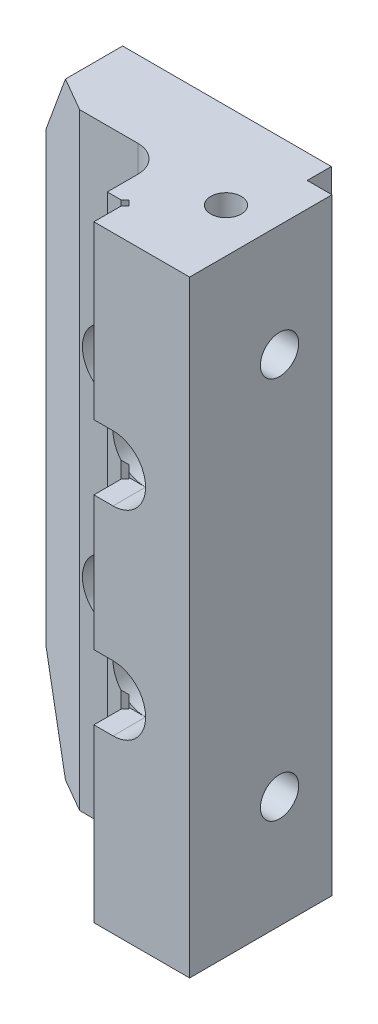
ISO-10303-21;
HEADER;
FILE_DESCRIPTION(('STEP AP214'),'2;1');
FILE_NAME('part.step','',(''),(''),'','','');
FILE_SCHEMA(('AUTOMOTIVE_DESIGN { 1 0 10303 214 1 1 1 1 }'));
ENDSEC;
DATA;
#1=APPLICATION_CONTEXT('core data for automotive mechanical design processes');
#2=APPLICATION_PROTOCOL_DEFINITION('international standard','automotive_design',2000,#1);
#3=PRODUCT_CONTEXT('',#1,'mechanical');
#4=PRODUCT('Part','Part','',(#3));
#5=PRODUCT_RELATED_PRODUCT_CATEGORY('part','',(#4));
#6=PRODUCT_DEFINITION_FORMATION('','',#4);
#7=PRODUCT_DEFINITION_CONTEXT('part definition',#1,'design');
#8=PRODUCT_DEFINITION('design','',#6,#7);
#9=PRODUCT_DEFINITION_SHAPE('','',#8);
#10=(LENGTH_UNIT() NAMED_UNIT(*) SI_UNIT(.MILLI.,.METRE.));
#11=(NAMED_UNIT(*) PLANE_ANGLE_UNIT() SI_UNIT($,.RADIAN.));
#12=(NAMED_UNIT(*) SI_UNIT($,.STERADIAN.) SOLID_ANGLE_UNIT());
#13=UNCERTAINTY_MEASURE_WITH_UNIT(LENGTH_MEASURE(1.E-05),#10,'distance_accuracy_value','');
#14=(GEOMETRIC_REPRESENTATION_CONTEXT(3) GLOBAL_UNCERTAINTY_ASSIGNED_CONTEXT((#13)) GLOBAL_UNIT_ASSIGNED_CONTEXT((#10,
#11,#12)) REPRESENTATION_CONTEXT('',''));
#15=CARTESIAN_POINT('',(0.,0.,0.));
#16=DIRECTION('',(0.,0.,1.));
#17=DIRECTION('',(1.,0.,0.));
#18=AXIS2_PLACEMENT_3D('',#15,#16,#17);
#19=CARTESIAN_POINT('',(43.,105.25,43.5));
#20=DIRECTION('',(-0.999999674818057,0.,0.000806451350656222));
#21=DIRECTION('',(-0.000806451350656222,0.,-0.999999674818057));
#22=AXIS2_PLACEMENT_3D('',#19,#20,#21);
#23=PLANE('',#22);
#24=CARTESIAN_POINT('',(42.981048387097,76.,20.));
#25=DIRECTION('',(0.999999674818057,0.,-0.000806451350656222));
#26=DIRECTION('',(-0.000806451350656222,0.,-0.999999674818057));
#27=AXIS2_PLACEMENT_3D('',#24,#25,#26);
#28=CIRCLE('',#27,5.);
#29=CARTESIAN_POINT('',(42.9770161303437,76.,15.0000016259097));
#30=VERTEX_POINT('',#29);
#31=EDGE_CURVE('E1873',#30,#30,#28,.T.);
#32=ORIENTED_EDGE('',*,*,#31,.F.);
#33=EDGE_LOOP('',(#32));
#34=FACE_BOUND('',#33,.T.);
#35=CARTESIAN_POINT('',(42.9810483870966,-24.,20.));
#36=DIRECTION('',(0.999999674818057,0.,-0.000806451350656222));
#37=DIRECTION('',(-0.000806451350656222,0.,-0.999999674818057));
#38=AXIS2_PLACEMENT_3D('',#35,#36,#37);
#39=CIRCLE('',#38,5.);
#40=CARTESIAN_POINT('',(42.9770161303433,-24.,15.0000016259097));
#41=VERTEX_POINT('',#40);
#42=EDGE_CURVE('E1867',#41,#41,#39,.T.);
#43=ORIENTED_EDGE('',*,*,#42,.F.);
#44=EDGE_LOOP('',(#43));
#45=FACE_BOUND('',#44,.T.);
#46=DIRECTION('',(-0.000806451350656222,0.,-0.999999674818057));
#47=VECTOR('',#46,1.);
#48=CARTESIAN_POINT('',(43.,105.25,43.5));
#49=LINE('',#48,#47);
#50=CARTESIAN_POINT('',(43.,105.25,43.5));
#51=VERTEX_POINT('',#50);
#52=CARTESIAN_POINT('',(42.97,105.25,6.30000000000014));
#53=VERTEX_POINT('',#52);
#54=EDGE_CURVE('E991',#51,#53,#49,.T.);
#55=ORIENTED_EDGE('',*,*,#54,.F.);
#56=DIRECTION('',(0.,1.,0.));
#57=VECTOR('',#56,1.);
#58=CARTESIAN_POINT('',(43.,-53.25,43.5));
#59=LINE('',#58,#57);
#60=CARTESIAN_POINT('',(43.,-53.25,43.5));
#61=VERTEX_POINT('',#60);
#62=EDGE_CURVE('E482',#61,#51,#59,.T.);
#63=ORIENTED_EDGE('',*,*,#62,.F.);
#64=DIRECTION('',(-0.000806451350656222,0.,-0.999999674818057));
#65=VECTOR('',#64,1.);
#66=CARTESIAN_POINT('',(42.9649193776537,-53.25,2.82908246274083E-05));
#67=LINE('',#66,#65);
#68=CARTESIAN_POINT('',(42.97,-53.25,6.30000000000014));
#69=VERTEX_POINT('',#68);
#70=EDGE_CURVE('E967',#61,#69,#67,.T.);
#71=ORIENTED_EDGE('',*,*,#70,.T.);
#72=DIRECTION('',(0.,-1.,0.));
#73=VECTOR('',#72,1.);
#74=CARTESIAN_POINT('',(42.97,-53.25,6.30000000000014));
#75=LINE('',#74,#73);
#76=EDGE_CURVE('E952',#69,#53,#75,.F.);
#77=ORIENTED_EDGE('',*,*,#76,.T.);
#78=EDGE_LOOP('',(#55,#63,#71,#77));
#79=FACE_BOUND('',#78,.T.);
#80=ADVANCED_FACE('F17',(#34,#45,#79),#23,.F.);
#81=CARTESIAN_POINT('',(37.,26.,-3.99999999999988));
#82=DIRECTION('',(0.,0.,1.));
#83=DIRECTION('',(0.,1.,0.));
#84=AXIS2_PLACEMENT_3D('',#81,#82,#83);
#85=PLANE('',#84);
#86=CARTESIAN_POINT('',(2.01227923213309E-13,52.,-4.));
#87=DIRECTION('',(0.,0.,1.));
#88=DIRECTION('',(0.,1.,0.));
#89=AXIS2_PLACEMENT_3D('',#86,#87,#88);
#90=CIRCLE('',#89,5.5);
#91=CARTESIAN_POINT('',(2.20431070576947E-13,57.5,-4.));
#92=VERTEX_POINT('',#91);
#93=EDGE_CURVE('E543',#92,#92,#90,.F.);
#94=ORIENTED_EDGE('',*,*,#93,.F.);
#95=EDGE_LOOP('',(#94));
#96=FACE_BOUND('',#95,.T.);
#97=DIRECTION('',(0.,-1.,0.));
#98=VECTOR('',#97,1.);
#99=CARTESIAN_POINT('',(-8.99999999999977,60.8,-4.));
#100=LINE('',#99,#98);
#101=CARTESIAN_POINT('',(-8.99999999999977,60.8,-4.));
#102=VERTEX_POINT('',#101);
#103=CARTESIAN_POINT('',(-9.,-8.8,-4.));
#104=VERTEX_POINT('',#103);
#105=EDGE_CURVE('E914',#102,#104,#100,.T.);
#106=ORIENTED_EDGE('',*,*,#105,.F.);
#107=DIRECTION('',(-1.,0.,0.));
#108=VECTOR('',#107,1.);
#109=CARTESIAN_POINT('',(9.00000000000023,60.8,-4.));
#110=LINE('',#109,#108);
#111=CARTESIAN_POINT('',(9.00000000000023,60.8,-4.));
#112=VERTEX_POINT('',#111);
#113=EDGE_CURVE('E925',#112,#102,#110,.T.);
#114=ORIENTED_EDGE('',*,*,#113,.F.);
#115=DIRECTION('',(0.,1.,0.));
#116=VECTOR('',#115,1.);
#117=CARTESIAN_POINT('',(9.00000000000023,60.8,-4.));
#118=LINE('',#117,#116);
#119=CARTESIAN_POINT('',(9.,-8.8,-4.));
#120=VERTEX_POINT('',#119);
#121=EDGE_CURVE('E922',#120,#112,#118,.T.);
#122=ORIENTED_EDGE('',*,*,#121,.F.);
#123=DIRECTION('',(1.,0.,0.));
#124=VECTOR('',#123,1.);
#125=CARTESIAN_POINT('',(9.,-8.8,-4.));
#126=LINE('',#125,#124);
#127=EDGE_CURVE('E918',#104,#120,#126,.T.);
#128=ORIENTED_EDGE('',*,*,#127,.F.);
#129=EDGE_LOOP('',(#106,#114,#122,#128));
#130=FACE_BOUND('',#129,.T.);
#131=CARTESIAN_POINT('',(0.,0.,-4.));
#132=DIRECTION('',(0.,0.,1.));
#133=DIRECTION('',(0.,1.,0.));
#134=AXIS2_PLACEMENT_3D('',#131,#132,#133);
#135=CIRCLE('',#134,5.5);
#136=CARTESIAN_POINT('',(0.,5.5,-4.));
#137=VERTEX_POINT('',#136);
#138=EDGE_CURVE('E888',#137,#137,#135,.T.);
#139=ORIENTED_EDGE('',*,*,#138,.T.);
#140=EDGE_LOOP('',(#139));
#141=FACE_BOUND('',#140,.T.);
#142=ADVANCED_FACE('F705',(#96,#130,#141),#85,.F.);
#143=CARTESIAN_POINT('',(-8.99999999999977,60.8,-4.));
#144=DIRECTION('',(1.,0.,0.));
#145=DIRECTION('',(0.,1.,0.));
#146=AXIS2_PLACEMENT_3D('',#143,#144,#145);
#147=PLANE('',#146);
#148=DIRECTION('',(0.,0.,1.));
#149=VECTOR('',#148,1.);
#150=CARTESIAN_POINT('',(-8.99999999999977,60.8,-4.));
#151=LINE('',#150,#149);
#152=CARTESIAN_POINT('',(-8.99999999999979,60.8,0.));
#153=VERTEX_POINT('',#152);
#154=EDGE_CURVE('E933',#153,#102,#151,.F.);
#155=ORIENTED_EDGE('',*,*,#154,.T.);
#156=ORIENTED_EDGE('',*,*,#105,.T.);
#157=DIRECTION('',(0.,0.,1.));
#158=VECTOR('',#157,1.);
#159=CARTESIAN_POINT('',(-9.,-8.8,-4.));
#160=LINE('',#159,#158);
#161=CARTESIAN_POINT('',(-9.,-8.8,0.));
#162=VERTEX_POINT('',#161);
#163=EDGE_CURVE('E941',#162,#104,#160,.F.);
#164=ORIENTED_EDGE('',*,*,#163,.F.);
#165=DIRECTION('',(0.,-1.,0.));
#166=VECTOR('',#165,1.);
#167=CARTESIAN_POINT('',(-9.00000000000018,-53.25,0.));
#168=LINE('',#167,#166);
#169=EDGE_CURVE('E956',#153,#162,#168,.T.);
#170=ORIENTED_EDGE('',*,*,#169,.F.);
#171=EDGE_LOOP('',(#155,#156,#164,#170));
#172=FACE_BOUND('',#171,.T.);
#173=ADVANCED_FACE('F701',(#172),#147,.F.);
#174=CARTESIAN_POINT('',(9.,-8.8,-4.));
#175=DIRECTION('',(0.,1.,0.));
#176=DIRECTION('',(0.,0.,-1.));
#177=AXIS2_PLACEMENT_3D('',#174,#175,#176);
#178=PLANE('',#177);
#179=ORIENTED_EDGE('',*,*,#163,.T.);
#180=ORIENTED_EDGE('',*,*,#127,.T.);
#181=DIRECTION('',(0.,0.,1.));
#182=VECTOR('',#181,1.);
#183=CARTESIAN_POINT('',(9.,-8.8,-4.));
#184=LINE('',#183,#182);
#185=CARTESIAN_POINT('',(9.,-8.8,0.));
#186=VERTEX_POINT('',#185);
#187=EDGE_CURVE('E929',#186,#120,#184,.F.);
#188=ORIENTED_EDGE('',*,*,#187,.F.);
#189=DIRECTION('',(-1.,0.,0.));
#190=VECTOR('',#189,1.);
#191=CARTESIAN_POINT('',(43.,-8.80000000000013,1.49186218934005E-13));
#192=LINE('',#191,#190);
#193=EDGE_CURVE('E550',#162,#186,#192,.F.);
#194=ORIENTED_EDGE('',*,*,#193,.F.);
#195=EDGE_LOOP('',(#179,#180,#188,#194));
#196=FACE_BOUND('',#195,.T.);
#197=ADVANCED_FACE('F704',(#196),#178,.F.);
#198=CARTESIAN_POINT('',(9.00000000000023,60.8,-4.));
#199=DIRECTION('',(-1.,0.,0.));
#200=DIRECTION('',(0.,-1.,0.));
#201=AXIS2_PLACEMENT_3D('',#198,#199,#200);
#202=PLANE('',#201);
#203=ORIENTED_EDGE('',*,*,#187,.T.);
#204=ORIENTED_EDGE('',*,*,#121,.T.);
#205=DIRECTION('',(0.,0.,1.));
#206=VECTOR('',#205,1.);
#207=CARTESIAN_POINT('',(9.00000000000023,60.8,-4.));
#208=LINE('',#207,#206);
#209=CARTESIAN_POINT('',(9.00000000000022,60.8,0.));
#210=VERTEX_POINT('',#209);
#211=EDGE_CURVE('E937',#210,#112,#208,.F.);
#212=ORIENTED_EDGE('',*,*,#211,.F.);
#213=DIRECTION('',(0.,-1.,0.));
#214=VECTOR('',#213,1.);
#215=CARTESIAN_POINT('',(8.99999999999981,-53.25,0.));
#216=LINE('',#215,#214);
#217=EDGE_CURVE('E1897',#186,#210,#216,.F.);
#218=ORIENTED_EDGE('',*,*,#217,.F.);
#219=EDGE_LOOP('',(#203,#204,#212,#218));
#220=FACE_BOUND('',#219,.T.);
#221=ADVANCED_FACE('F709',(#220),#202,.F.);
#222=CARTESIAN_POINT('',(9.00000000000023,60.8,-4.));
#223=DIRECTION('',(0.,-1.,0.));
#224=DIRECTION('',(0.,0.,1.));
#225=AXIS2_PLACEMENT_3D('',#222,#223,#224);
#226=PLANE('',#225);
#227=ORIENTED_EDGE('',*,*,#211,.T.);
#228=ORIENTED_EDGE('',*,*,#113,.T.);
#229=ORIENTED_EDGE('',*,*,#154,.F.);
#230=DIRECTION('',(-1.,0.,0.));
#231=VECTOR('',#230,1.);
#232=CARTESIAN_POINT('',(43.,60.8,1.42247325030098E-13));
#233=LINE('',#232,#231);
#234=EDGE_CURVE('E1895',#210,#153,#233,.T.);
#235=ORIENTED_EDGE('',*,*,#234,.F.);
#236=EDGE_LOOP('',(#227,#228,#229,#235));
#237=FACE_BOUND('',#236,.T.);
#238=ADVANCED_FACE('F698',(#237),#226,.F.);
#239=CARTESIAN_POINT('',(16.9393398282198,-53.25,37.474873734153));
#240=DIRECTION('',(0.707106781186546,0.,0.70710678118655));
#241=DIRECTION('',(-0.70710678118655,0.,0.707106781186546));
#242=AXIS2_PLACEMENT_3D('',#239,#240,#241);
#243=PLANE('',#242);
#244=DIRECTION('',(-0.70710678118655,0.,0.707106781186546));
#245=VECTOR('',#244,1.);
#246=CARTESIAN_POINT('',(16.93933982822,8.5,37.474873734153));
#247=LINE('',#246,#245);
#248=CARTESIAN_POINT('',(18.,8.5,36.4142135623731));
#249=VERTEX_POINT('',#248);
#250=CARTESIAN_POINT('',(19.0606601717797,8.5,35.3535533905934));
#251=VERTEX_POINT('',#250);
#252=EDGE_CURVE('E514',#249,#251,#247,.F.);
#253=ORIENTED_EDGE('',*,*,#252,.F.);
#254=DIRECTION('',(0.,-1.,0.));
#255=VECTOR('',#254,1.);
#256=CARTESIAN_POINT('',(18.0000000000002,105.25,36.4142135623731));
#257=LINE('',#256,#255);
#258=CARTESIAN_POINT('',(18.,43.5,36.4142135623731));
#259=VERTEX_POINT('',#258);
#260=EDGE_CURVE('E476',#249,#259,#257,.F.);
#261=ORIENTED_EDGE('',*,*,#260,.T.);
#262=DIRECTION('',(-0.70710678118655,0.,0.707106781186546));
#263=VECTOR('',#262,1.);
#264=CARTESIAN_POINT('',(16.9393398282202,43.5,37.474873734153));
#265=LINE('',#264,#263);
#266=CARTESIAN_POINT('',(19.0606601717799,43.5,35.3535533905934));
#267=VERTEX_POINT('',#266);
#268=EDGE_CURVE('E533',#267,#259,#265,.T.);
#269=ORIENTED_EDGE('',*,*,#268,.F.);
#270=DIRECTION('',(0.,-1.,0.));
#271=VECTOR('',#270,1.);
#272=CARTESIAN_POINT('',(19.0606601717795,-53.25,35.3535533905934));
#273=LINE('',#272,#271);
#274=EDGE_CURVE('E510',#267,#251,#273,.T.);
#275=ORIENTED_EDGE('',*,*,#274,.T.);
#276=EDGE_LOOP('',(#253,#261,#269,#275));
#277=FACE_BOUND('',#276,.T.);
#278=ADVANCED_FACE('F694',(#277),#243,.F.);
#279=CARTESIAN_POINT('',(19.0606601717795,-53.25,35.3535533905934));
#280=DIRECTION('',(0.707106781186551,0.,-0.707106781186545));
#281=DIRECTION('',(0.707106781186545,0.,0.707106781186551));
#282=AXIS2_PLACEMENT_3D('',#279,#280,#281);
#283=PLANE('',#282);
#284=DIRECTION('',(0.,-1.,0.));
#285=VECTOR('',#284,1.);
#286=CARTESIAN_POINT('',(18.7071067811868,105.25,35.));
#287=LINE('',#286,#285);
#288=CARTESIAN_POINT('',(18.7071067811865,43.5,35.));
#289=VERTEX_POINT('',#288);
#290=CARTESIAN_POINT('',(18.7071067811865,44.6637156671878,35.));
#291=VERTEX_POINT('',#290);
#292=EDGE_CURVE('E441',#289,#291,#287,.F.);
#293=ORIENTED_EDGE('',*,*,#292,.T.);
#294=CARTESIAN_POINT('',(23.,52.,39.2928932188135));
#295=DIRECTION('',(0.707106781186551,0.,-0.707106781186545));
#296=DIRECTION('',(0.707106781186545,0.,0.707106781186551));
#297=AXIS2_PLACEMENT_3D('',#294,#295,#296);
#298=ELLIPSE('',#297,12.0208152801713,8.5);
#299=CARTESIAN_POINT('',(17.646446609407,45.3977680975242,33.9393398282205));
#300=VERTEX_POINT('',#299);
#301=EDGE_CURVE('E1120',#300,#291,#298,.F.);
#302=ORIENTED_EDGE('',*,*,#301,.F.);
#303=DIRECTION('',(0.,-1.,0.));
#304=VECTOR('',#303,1.);
#305=CARTESIAN_POINT('',(17.6464466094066,-53.25,33.9393398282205));
#306=LINE('',#305,#304);
#307=CARTESIAN_POINT('',(17.6464466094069,6.60223190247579,33.9393398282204));
#308=VERTEX_POINT('',#307);
#309=EDGE_CURVE('E435',#300,#308,#306,.T.);
#310=ORIENTED_EDGE('',*,*,#309,.T.);
#311=CARTESIAN_POINT('',(23.,0.,39.2928932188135));
#312=DIRECTION('',(0.707106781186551,0.,-0.707106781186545));
#313=DIRECTION('',(0.707106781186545,0.,0.707106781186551));
#314=AXIS2_PLACEMENT_3D('',#311,#312,#313);
#315=ELLIPSE('',#314,12.0208152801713,8.5);
#316=CARTESIAN_POINT('',(18.7071067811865,7.33628433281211,35.));
#317=VERTEX_POINT('',#316);
#318=EDGE_CURVE('E502',#317,#308,#315,.F.);
#319=ORIENTED_EDGE('',*,*,#318,.F.);
#320=DIRECTION('',(0.,-1.,0.));
#321=VECTOR('',#320,1.);
#322=CARTESIAN_POINT('',(18.7071067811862,-53.25,35.));
#323=LINE('',#322,#321);
#324=CARTESIAN_POINT('',(18.7071067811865,8.5,35.));
#325=VERTEX_POINT('',#324);
#326=EDGE_CURVE('E499',#325,#317,#323,.T.);
#327=ORIENTED_EDGE('',*,*,#326,.F.);
#328=DIRECTION('',(0.707106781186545,0.,0.707106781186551));
#329=VECTOR('',#328,1.);
#330=CARTESIAN_POINT('',(19.0606601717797,8.5,35.3535533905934));
#331=LINE('',#330,#329);
#332=EDGE_CURVE('E503',#251,#325,#331,.F.);
#333=ORIENTED_EDGE('',*,*,#332,.F.);
#334=ORIENTED_EDGE('',*,*,#274,.F.);
#335=DIRECTION('',(-0.707106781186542,0.,-0.707106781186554));
#336=VECTOR('',#335,1.);
#337=CARTESIAN_POINT('',(19.0606601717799,43.5,35.3535533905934));
#338=LINE('',#337,#336);
#339=EDGE_CURVE('E451',#267,#289,#338,.T.);
#340=ORIENTED_EDGE('',*,*,#339,.T.);
#341=EDGE_LOOP('',(#293,#302,#310,#319,#327,#333,#334,#340));
#342=FACE_BOUND('',#341,.T.);
#343=ADVANCED_FACE('F690',(#342),#283,.F.);
#344=CARTESIAN_POINT('',(0.,-5.5,9.4));
#345=DIRECTION('',(0.,0.,-1.));
#346=DIRECTION('',(1.,0.,0.));
#347=AXIS2_PLACEMENT_3D('',#344,#345,#346);
#348=PLANE('',#347);
#349=CARTESIAN_POINT('',(0.,0.,9.4));
#350=DIRECTION('',(0.,0.,1.));
#351=DIRECTION('',(-1.,0.,0.));
#352=AXIS2_PLACEMENT_3D('',#349,#350,#351);
#353=CIRCLE('',#352,8.5);
#354=CARTESIAN_POINT('',(-8.50000000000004,0.,9.39999999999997));
#355=VERTEX_POINT('',#354);
#356=EDGE_CURVE('E528',#355,#355,#353,.T.);
#357=ORIENTED_EDGE('',*,*,#356,.T.);
#358=EDGE_LOOP('',(#357));
#359=FACE_BOUND('',#358,.T.);
#360=CARTESIAN_POINT('',(0.,0.,9.4));
#361=DIRECTION('',(0.,0.,1.));
#362=DIRECTION('',(-1.,0.,0.));
#363=AXIS2_PLACEMENT_3D('',#360,#361,#362);
#364=CIRCLE('',#363,5.5);
#365=CARTESIAN_POINT('',(-5.50000000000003,0.,9.39999999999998));
#366=VERTEX_POINT('',#365);
#367=EDGE_CURVE('E409',#366,#366,#364,.F.);
#368=ORIENTED_EDGE('',*,*,#367,.T.);
#369=EDGE_LOOP('',(#368));
#370=FACE_BOUND('',#369,.T.);
#371=ADVANCED_FACE('F686',(#359,#370),#348,.F.);
#372=CARTESIAN_POINT('',(1.38777878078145E-13,46.5,9.4));
#373=DIRECTION('',(0.,0.,-1.));
#374=DIRECTION('',(1.,0.,0.));
#375=AXIS2_PLACEMENT_3D('',#372,#373,#374);
#376=PLANE('',#375);
#377=CARTESIAN_POINT('',(1.52655665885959E-13,52.,9.4));
#378=DIRECTION('',(0.,0.,1.));
#379=DIRECTION('',(-1.,0.,0.));
#380=AXIS2_PLACEMENT_3D('',#377,#378,#379);
#381=CIRCLE('',#380,8.5);
#382=CARTESIAN_POINT('',(-8.49999999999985,52.,9.39999999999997));
#383=VERTEX_POINT('',#382);
#384=EDGE_CURVE('E1123',#383,#383,#381,.T.);
#385=ORIENTED_EDGE('',*,*,#384,.T.);
#386=EDGE_LOOP('',(#385));
#387=FACE_BOUND('',#386,.T.);
#388=CARTESIAN_POINT('',(1.52655665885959E-13,52.,9.4));
#389=DIRECTION('',(0.,0.,1.));
#390=DIRECTION('',(-1.,0.,0.));
#391=AXIS2_PLACEMENT_3D('',#388,#389,#390);
#392=CIRCLE('',#391,5.5);
#393=CARTESIAN_POINT('',(-5.49999999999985,52.,9.39999999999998));
#394=VERTEX_POINT('',#393);
#395=EDGE_CURVE('E389',#394,#394,#392,.F.);
#396=ORIENTED_EDGE('',*,*,#395,.T.);
#397=EDGE_LOOP('',(#396));
#398=FACE_BOUND('',#397,.T.);
#399=ADVANCED_FACE('F682',(#387,#398),#376,.F.);
#400=CARTESIAN_POINT('',(1.17961196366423E-13,52.,20.));
#401=DIRECTION('',(0.,0.,1.));
#402=DIRECTION('',(-1.,0.,0.));
#403=AXIS2_PLACEMENT_3D('',#400,#401,#402);
#404=CYLINDRICAL_SURFACE('',#403,8.5);
#405=ORIENTED_EDGE('',*,*,#384,.F.);
#406=EDGE_LOOP('',(#405));
#407=FACE_BOUND('',#406,.T.);
#408=CARTESIAN_POINT('',(1.17961196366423E-13,52.,20.));
#409=DIRECTION('',(0.,0.,1.));
#410=DIRECTION('',(-1.,0.,0.));
#411=AXIS2_PLACEMENT_3D('',#408,#409,#410);
#412=CIRCLE('',#411,8.5);
#413=CARTESIAN_POINT('',(6.00000000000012,58.0207972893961,20.));
#414=VERTEX_POINT('',#413);
#415=CARTESIAN_POINT('',(6.00000000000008,45.9792027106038,20.));
#416=VERTEX_POINT('',#415);
#417=EDGE_CURVE('E794',#414,#416,#412,.T.);
#418=ORIENTED_EDGE('',*,*,#417,.T.);
#419=CARTESIAN_POINT('',(6.00000000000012,58.0207972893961,20.));
#420=CARTESIAN_POINT('',(6.16466835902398,57.8567414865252,20.0000132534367));
#421=CARTESIAN_POINT('',(6.32247087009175,57.6859822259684,20.0058089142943));
#422=CARTESIAN_POINT('',(6.62322989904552,57.3325853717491,20.0261686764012));
#423=CARTESIAN_POINT('',(6.76619970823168,57.1499586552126,20.040724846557));
#424=CARTESIAN_POINT('',(7.03644200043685,56.7741071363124,20.0758143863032));
#425=CARTESIAN_POINT('',(7.16371891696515,56.5808853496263,20.0963460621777));
#426=CARTESIAN_POINT('',(7.40198850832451,56.1849669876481,20.1407637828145));
#427=CARTESIAN_POINT('',(7.51297742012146,55.9822682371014,20.1646506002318));
#428=CARTESIAN_POINT('',(7.71782818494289,55.5690601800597,20.2132388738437));
#429=CARTESIAN_POINT('',(7.81172756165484,55.3585692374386,20.2379384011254));
#430=CARTESIAN_POINT('',(7.98217462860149,54.9305208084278,20.285923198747));
#431=CARTESIAN_POINT('',(8.05872282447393,54.7129635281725,20.3092085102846));
#432=CARTESIAN_POINT('',(8.19392117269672,54.2721706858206,20.3523126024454));
#433=CARTESIAN_POINT('',(8.25258321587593,54.0489390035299,20.3721336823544));
#434=CARTESIAN_POINT('',(8.35161700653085,53.5980508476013,20.406620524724));
#435=CARTESIAN_POINT('',(8.3919886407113,53.370394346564,20.4212862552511));
#436=CARTESIAN_POINT('',(8.45486581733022,52.9063422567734,20.4444835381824));
#437=CARTESIAN_POINT('',(8.47688692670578,52.6698722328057,20.4528482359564));
#438=CARTESIAN_POINT('',(8.50105965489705,52.1957661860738,20.4620438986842));
#439=CARTESIAN_POINT('',(8.5032110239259,51.9581301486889,20.4628747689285));
#440=CARTESIAN_POINT('',(8.48761751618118,51.4835280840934,20.456925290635));
#441=CARTESIAN_POINT('',(8.46986569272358,51.2465623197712,20.4501422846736));
#442=CARTESIAN_POINT('',(8.41464804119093,50.7752577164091,20.4295861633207));
#443=CARTESIAN_POINT('',(8.37718260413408,50.5409188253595,20.415813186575));
#444=CARTESIAN_POINT('',(8.28541359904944,50.0889114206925,20.3834214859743));
#445=CARTESIAN_POINT('',(8.23210784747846,49.8710176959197,20.365098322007));
#446=CARTESIAN_POINT('',(8.10856390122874,49.4404380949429,20.3248089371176));
#447=CARTESIAN_POINT('',(8.038325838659,49.2277521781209,20.3028427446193));
#448=CARTESIAN_POINT('',(7.88140241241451,48.808838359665,20.2570779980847));
#449=CARTESIAN_POINT('',(7.7947229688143,48.6026081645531,20.2332801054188));
#450=CARTESIAN_POINT('',(7.60537612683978,48.1976037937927,20.1858758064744));
#451=CARTESIAN_POINT('',(7.50270961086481,47.998829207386,20.1622693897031));
#452=CARTESIAN_POINT('',(7.29787170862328,47.6379275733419,20.1206969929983));
#453=CARTESIAN_POINT('',(7.19777467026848,47.4746569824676,20.1024089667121));
#454=CARTESIAN_POINT('',(6.98664044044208,47.1550512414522,20.0690578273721));
#455=CARTESIAN_POINT('',(6.8756061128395,46.9987142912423,20.0539938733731));
#456=CARTESIAN_POINT('',(6.64294964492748,46.693587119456,20.0286073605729));
#457=CARTESIAN_POINT('',(6.52132284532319,46.5448002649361,20.0182869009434));
#458=CARTESIAN_POINT('',(6.26802995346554,46.2555365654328,20.0039835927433));
#459=CARTESIAN_POINT('',(6.13635686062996,46.1150656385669,20.0000052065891));
#460=CARTESIAN_POINT('',(6.00000000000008,45.9792027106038,20.));
#461=B_SPLINE_CURVE_WITH_KNOTS('',3,(#419,#420,#421,#422,#423,#424,#425,#426,#427,#428,#429,
#430,#431,#432,#433,#434,#435,#436,#437,#438,#439,#440,#441,#442,#443,#444,#445,#446,#447,#448,
#449,#450,#451,#452,#453,#454,#455,#456,#457,#458,#459,#460),.UNSPECIFIED.,.F.,.F.,(4,2,2,2,2,2,
2,2,2,2,2,2,2,2,2,2,2,2,2,2,4),(0.,0.696875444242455,1.39312093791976,2.08916927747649,
2.78537817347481,3.48003945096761,4.17468048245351,4.86885870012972,5.563041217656,
6.27501581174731,6.98699935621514,7.69923147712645,8.41144947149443,9.08591460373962,
9.76037447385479,10.4345919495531,11.1087722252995,11.6854828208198,12.2620428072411,
12.8388576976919,13.4160782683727),.UNSPECIFIED.);
#462=EDGE_CURVE('E32',#414,#416,#461,.T.);
#463=ORIENTED_EDGE('',*,*,#462,.F.);
#464=EDGE_LOOP('',(#418,#463));
#465=FACE_BOUND('',#464,.T.);
#466=ADVANCED_FACE('F685',(#407,#465),#404,.F.);
#467=CARTESIAN_POINT('',(0.,0.,20.));
#468=DIRECTION('',(0.,0.,1.));
#469=DIRECTION('',(-1.,0.,0.));
#470=AXIS2_PLACEMENT_3D('',#467,#468,#469);
#471=CYLINDRICAL_SURFACE('',#470,8.5);
#472=ORIENTED_EDGE('',*,*,#356,.F.);
#473=EDGE_LOOP('',(#472));
#474=FACE_BOUND('',#473,.T.);
#475=CARTESIAN_POINT('',(0.,0.,20.));
#476=DIRECTION('',(0.,0.,1.));
#477=DIRECTION('',(-1.,0.,0.));
#478=AXIS2_PLACEMENT_3D('',#475,#476,#477);
#479=CIRCLE('',#478,8.5);
#480=CARTESIAN_POINT('',(6.,6.02079728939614,20.));
#481=VERTEX_POINT('',#480);
#482=CARTESIAN_POINT('',(5.9999999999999,-6.02079728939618,20.));
#483=VERTEX_POINT('',#482);
#484=EDGE_CURVE('E744',#481,#483,#479,.T.);
#485=ORIENTED_EDGE('',*,*,#484,.T.);
#486=CARTESIAN_POINT('',(6.,6.02079728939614,20.));
#487=CARTESIAN_POINT('',(6.16466835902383,5.85674148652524,20.0000132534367));
#488=CARTESIAN_POINT('',(6.32247087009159,5.68598222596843,20.0058089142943));
#489=CARTESIAN_POINT('',(6.62322989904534,5.33258537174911,20.0261686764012));
#490=CARTESIAN_POINT('',(6.7661997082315,5.14995865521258,20.040724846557));
#491=CARTESIAN_POINT('',(7.03644200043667,4.77410713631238,20.0758143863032));
#492=CARTESIAN_POINT('',(7.16371891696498,4.58088534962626,20.0963460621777));
#493=CARTESIAN_POINT('',(7.40198850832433,4.18496698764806,20.1407637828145));
#494=CARTESIAN_POINT('',(7.51297742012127,3.98226823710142,20.1646506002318));
#495=CARTESIAN_POINT('',(7.7178281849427,3.56906018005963,20.2132388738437));
#496=CARTESIAN_POINT('',(7.81172756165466,3.35856923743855,20.2379384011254));
#497=CARTESIAN_POINT('',(7.98217462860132,2.93052080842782,20.285923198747));
#498=CARTESIAN_POINT('',(8.05872282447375,2.71296352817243,20.3092085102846));
#499=CARTESIAN_POINT('',(8.19392117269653,2.27217068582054,20.3523126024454));
#500=CARTESIAN_POINT('',(8.25258321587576,2.04893900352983,20.3721336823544));
#501=CARTESIAN_POINT('',(8.35161700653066,1.59805084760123,20.406620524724));
#502=CARTESIAN_POINT('',(8.3919886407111,1.37039434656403,20.4212862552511));
#503=CARTESIAN_POINT('',(8.45486581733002,0.906342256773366,20.4444835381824));
#504=CARTESIAN_POINT('',(8.47688692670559,0.669872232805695,20.4528482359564));
#505=CARTESIAN_POINT('',(8.50105965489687,0.195766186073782,20.4620438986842));
#506=CARTESIAN_POINT('',(8.50321102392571,-0.0418698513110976,20.4628747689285));
#507=CARTESIAN_POINT('',(8.487617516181,-0.516471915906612,20.456925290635));
#508=CARTESIAN_POINT('',(8.46986569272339,-0.753437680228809,20.4501422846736));
#509=CARTESIAN_POINT('',(8.41464804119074,-1.22474228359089,20.4295861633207));
#510=CARTESIAN_POINT('',(8.37718260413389,-1.45908117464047,20.415813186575));
#511=CARTESIAN_POINT('',(8.28541359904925,-1.91108857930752,20.3834214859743));
#512=CARTESIAN_POINT('',(8.23210784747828,-2.1289823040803,20.365098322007));
#513=CARTESIAN_POINT('',(8.10856390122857,-2.55956190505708,20.3248089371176));
#514=CARTESIAN_POINT('',(8.03832583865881,-2.77224782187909,20.3028427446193));
#515=CARTESIAN_POINT('',(7.88140241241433,-3.19116164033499,20.2570779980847));
#516=CARTESIAN_POINT('',(7.79472296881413,-3.39739183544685,20.2332801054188));
#517=CARTESIAN_POINT('',(7.60537612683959,-3.8023962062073,20.1858758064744));
#518=CARTESIAN_POINT('',(7.5027096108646,-4.00117079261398,20.1622693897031));
#519=CARTESIAN_POINT('',(7.29787170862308,-4.36207242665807,20.1206969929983));
#520=CARTESIAN_POINT('',(7.19777467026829,-4.52534301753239,20.1024089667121));
#521=CARTESIAN_POINT('',(6.98664044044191,-4.8449487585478,20.0690578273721));
#522=CARTESIAN_POINT('',(6.87560611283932,-5.00128570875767,20.0539938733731));
#523=CARTESIAN_POINT('',(6.64294964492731,-5.30641288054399,20.0286073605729));
#524=CARTESIAN_POINT('',(6.52132284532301,-5.45519973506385,20.0182869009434));
#525=CARTESIAN_POINT('',(6.26802995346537,-5.74446343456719,20.0039835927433));
#526=CARTESIAN_POINT('',(6.13635686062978,-5.88493436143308,20.0000052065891));
#527=CARTESIAN_POINT('',(5.9999999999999,-6.02079728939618,20.));
#528=B_SPLINE_CURVE_WITH_KNOTS('',3,(#486,#487,#488,#489,#490,#491,#492,#493,#494,#495,#496,
#497,#498,#499,#500,#501,#502,#503,#504,#505,#506,#507,#508,#509,#510,#511,#512,#513,#514,#515,
#516,#517,#518,#519,#520,#521,#522,#523,#524,#525,#526,#527),.UNSPECIFIED.,.F.,.F.,(4,2,2,2,2,2,
2,2,2,2,2,2,2,2,2,2,2,2,2,2,4),(0.,0.696875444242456,1.39312093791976,2.08916927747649,
2.78537817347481,3.48003945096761,4.17468048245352,4.86885870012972,5.56304121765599,
6.2750158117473,6.98699935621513,7.69923147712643,8.4114494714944,9.08591460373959,
9.76037447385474,10.434591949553,11.1087722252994,11.6854828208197,12.2620428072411,
12.8388576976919,13.4160782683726),.UNSPECIFIED.);
#529=EDGE_CURVE('E11',#481,#483,#528,.T.);
#530=ORIENTED_EDGE('',*,*,#529,.F.);
#531=EDGE_LOOP('',(#485,#530));
#532=FACE_BOUND('',#531,.T.);
#533=ADVANCED_FACE('F19',(#474,#532),#471,.F.);
#534=CARTESIAN_POINT('',(18.,105.25,55.));
#535=DIRECTION('',(1.,0.,0.));
#536=DIRECTION('',(0.,0.,1.));
#537=AXIS2_PLACEMENT_3D('',#534,#535,#536);
#538=PLANE('',#537);
#539=ORIENTED_EDGE('',*,*,#260,.F.);
#540=DIRECTION('',(0.,0.,-1.));
#541=VECTOR('',#540,1.);
#542=CARTESIAN_POINT('',(18.,8.5,-5.71854614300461));
#543=LINE('',#542,#541);
#544=CARTESIAN_POINT('',(18.,8.5,43.5));
#545=VERTEX_POINT('',#544);
#546=EDGE_CURVE('E874',#249,#545,#543,.F.);
#547=ORIENTED_EDGE('',*,*,#546,.T.);
#548=DIRECTION('',(0.,1.,0.));
#549=VECTOR('',#548,1.);
#550=CARTESIAN_POINT('',(17.9999999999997,-53.25,43.5));
#551=LINE('',#550,#549);
#552=CARTESIAN_POINT('',(18.,43.5,43.5));
#553=VERTEX_POINT('',#552);
#554=EDGE_CURVE('E362',#553,#545,#551,.F.);
#555=ORIENTED_EDGE('',*,*,#554,.F.);
#556=DIRECTION('',(0.,0.,-1.));
#557=VECTOR('',#556,1.);
#558=CARTESIAN_POINT('',(18.,43.5,55.));
#559=LINE('',#558,#557);
#560=EDGE_CURVE('E862',#259,#553,#559,.F.);
#561=ORIENTED_EDGE('',*,*,#560,.F.);
#562=EDGE_LOOP('',(#539,#547,#555,#561));
#563=FACE_BOUND('',#562,.T.);
#564=ADVANCED_FACE('F677',(#563),#538,.F.);
#565=CARTESIAN_POINT('',(-30.,105.25,35.));
#566=DIRECTION('',(0.,0.,-1.));
#567=DIRECTION('',(1.,0.,0.));
#568=AXIS2_PLACEMENT_3D('',#565,#566,#567);
#569=PLANE('',#568);
#570=DIRECTION('',(0.,-1.,0.));
#571=VECTOR('',#570,1.);
#572=CARTESIAN_POINT('',(18.7071067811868,105.25,35.));
#573=LINE('',#572,#571);
#574=CARTESIAN_POINT('',(18.7071067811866,59.3362843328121,35.));
#575=VERTEX_POINT('',#574);
#576=CARTESIAN_POINT('',(18.7071067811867,60.5,35.));
#577=VERTEX_POINT('',#576);
#578=EDGE_CURVE('E471',#575,#577,#573,.F.);
#579=ORIENTED_EDGE('',*,*,#578,.F.);
#580=CARTESIAN_POINT('',(23.,52.,35.));
#581=DIRECTION('',(0.,0.,1.));
#582=DIRECTION('',(-1.,0.,0.));
#583=AXIS2_PLACEMENT_3D('',#580,#581,#582);
#584=CIRCLE('',#583,8.5);
#585=CARTESIAN_POINT('',(23.,60.5,35.));
#586=VERTEX_POINT('',#585);
#587=EDGE_CURVE('E463',#575,#586,#584,.F.);
#588=ORIENTED_EDGE('',*,*,#587,.T.);
#589=DIRECTION('',(-1.,0.,0.));
#590=VECTOR('',#589,1.);
#591=CARTESIAN_POINT('',(23.,60.5,35.));
#592=LINE('',#591,#590);
#593=EDGE_CURVE('E466',#586,#577,#592,.T.);
#594=ORIENTED_EDGE('',*,*,#593,.T.);
#595=EDGE_LOOP('',(#579,#588,#594));
#596=FACE_BOUND('',#595,.T.);
#597=ADVANCED_FACE('F673',(#596),#569,.F.);
#598=CARTESIAN_POINT('',(23.0000000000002,60.5,-5.7185461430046));
#599=DIRECTION('',(0.,1.,0.));
#600=DIRECTION('',(-1.,0.,0.));
#601=AXIS2_PLACEMENT_3D('',#598,#599,#600);
#602=PLANE('',#601);
#603=DIRECTION('',(0.,0.,1.));
#604=VECTOR('',#603,1.);
#605=CARTESIAN_POINT('',(23.,60.5,43.5));
#606=LINE('',#605,#604);
#607=CARTESIAN_POINT('',(23.,60.5,43.5));
#608=VERTEX_POINT('',#607);
#609=EDGE_CURVE('E458',#586,#608,#606,.T.);
#610=ORIENTED_EDGE('',*,*,#609,.T.);
#611=DIRECTION('',(1.,0.,0.));
#612=VECTOR('',#611,1.);
#613=CARTESIAN_POINT('',(23.,60.5,43.5));
#614=LINE('',#613,#612);
#615=CARTESIAN_POINT('',(18.,60.5,43.5));
#616=VERTEX_POINT('',#615);
#617=EDGE_CURVE('E821',#616,#608,#614,.T.);
#618=ORIENTED_EDGE('',*,*,#617,.F.);
#619=DIRECTION('',(0.,0.,-1.));
#620=VECTOR('',#619,1.);
#621=CARTESIAN_POINT('',(18.0000000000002,60.5,-5.71854614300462));
#622=LINE('',#621,#620);
#623=CARTESIAN_POINT('',(18.,60.5,36.4142135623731));
#624=VERTEX_POINT('',#623);
#625=EDGE_CURVE('E868',#624,#616,#622,.F.);
#626=ORIENTED_EDGE('',*,*,#625,.F.);
#627=DIRECTION('',(-0.70710678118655,0.,0.707106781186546));
#628=VECTOR('',#627,1.);
#629=CARTESIAN_POINT('',(16.9393398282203,60.5,37.474873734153));
#630=LINE('',#629,#628);
#631=CARTESIAN_POINT('',(19.0606601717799,60.5,35.3535533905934));
#632=VERTEX_POINT('',#631);
#633=EDGE_CURVE('E385',#624,#632,#630,.F.);
#634=ORIENTED_EDGE('',*,*,#633,.T.);
#635=DIRECTION('',(0.707106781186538,0.,0.707106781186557));
#636=VECTOR('',#635,1.);
#637=CARTESIAN_POINT('',(18.7071067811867,60.5,35.));
#638=LINE('',#637,#636);
#639=EDGE_CURVE('E470',#577,#632,#638,.T.);
#640=ORIENTED_EDGE('',*,*,#639,.F.);
#641=ORIENTED_EDGE('',*,*,#593,.F.);
#642=EDGE_LOOP('',(#610,#618,#626,#634,#640,#641));
#643=FACE_BOUND('',#642,.T.);
#644=ADVANCED_FACE('F669',(#643),#602,.F.);
#645=CARTESIAN_POINT('',(23.,43.5,-5.7185461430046));
#646=DIRECTION('',(0.,-1.,0.));
#647=DIRECTION('',(1.,0.,0.));
#648=AXIS2_PLACEMENT_3D('',#645,#646,#647);
#649=PLANE('',#648);
#650=ORIENTED_EDGE('',*,*,#560,.T.);
#651=DIRECTION('',(1.,0.,0.));
#652=VECTOR('',#651,1.);
#653=CARTESIAN_POINT('',(43.,43.5,43.5));
#654=LINE('',#653,#652);
#655=CARTESIAN_POINT('',(23.,43.5,43.5));
#656=VERTEX_POINT('',#655);
#657=EDGE_CURVE('E827',#553,#656,#654,.T.);
#658=ORIENTED_EDGE('',*,*,#657,.T.);
#659=DIRECTION('',(0.,0.,1.));
#660=VECTOR('',#659,1.);
#661=CARTESIAN_POINT('',(23.,43.5,43.5));
#662=LINE('',#661,#660);
#663=CARTESIAN_POINT('',(23.,43.5,35.));
#664=VERTEX_POINT('',#663);
#665=EDGE_CURVE('E454',#656,#664,#662,.F.);
#666=ORIENTED_EDGE('',*,*,#665,.T.);
#667=DIRECTION('',(1.,0.,0.));
#668=VECTOR('',#667,1.);
#669=CARTESIAN_POINT('',(-30.,43.5,35.));
#670=LINE('',#669,#668);
#671=EDGE_CURVE('E445',#664,#289,#670,.F.);
#672=ORIENTED_EDGE('',*,*,#671,.T.);
#673=ORIENTED_EDGE('',*,*,#339,.F.);
#674=ORIENTED_EDGE('',*,*,#268,.T.);
#675=EDGE_LOOP('',(#650,#658,#666,#672,#673,#674));
#676=FACE_BOUND('',#675,.T.);
#677=ADVANCED_FACE('F665',(#676),#649,.F.);
#678=CARTESIAN_POINT('',(-30.,105.25,35.));
#679=DIRECTION('',(0.,0.,-1.));
#680=DIRECTION('',(1.,0.,0.));
#681=AXIS2_PLACEMENT_3D('',#678,#679,#680);
#682=PLANE('',#681);
#683=ORIENTED_EDGE('',*,*,#671,.F.);
#684=CARTESIAN_POINT('',(23.,52.,35.));
#685=DIRECTION('',(0.,0.,1.));
#686=DIRECTION('',(-1.,0.,0.));
#687=AXIS2_PLACEMENT_3D('',#684,#685,#686);
#688=CIRCLE('',#687,8.5);
#689=EDGE_CURVE('E457',#664,#291,#688,.F.);
#690=ORIENTED_EDGE('',*,*,#689,.T.);
#691=ORIENTED_EDGE('',*,*,#292,.F.);
#692=EDGE_LOOP('',(#683,#690,#691));
#693=FACE_BOUND('',#692,.T.);
#694=ADVANCED_FACE('F661',(#693),#682,.F.);
#695=CARTESIAN_POINT('',(17.6464466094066,-53.25,33.9393398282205));
#696=DIRECTION('',(-0.707106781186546,0.,-0.70710678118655));
#697=DIRECTION('',(0.70710678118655,0.,-0.707106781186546));
#698=AXIS2_PLACEMENT_3D('',#695,#696,#697);
#699=PLANE('',#698);
#700=CARTESIAN_POINT('',(23.,0.,28.5857864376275));
#701=DIRECTION('',(-0.707106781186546,0.,-0.70710678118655));
#702=DIRECTION('',(-0.70710678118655,0.,0.707106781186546));
#703=AXIS2_PLACEMENT_3D('',#700,#701,#702);
#704=ELLIPSE('',#703,12.0208152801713,8.5);
#705=CARTESIAN_POINT('',(16.5857864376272,5.5774424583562,35.));
#706=VERTEX_POINT('',#705);
#707=EDGE_CURVE('E1149',#706,#308,#704,.T.);
#708=ORIENTED_EDGE('',*,*,#707,.T.);
#709=ORIENTED_EDGE('',*,*,#309,.F.);
#710=CARTESIAN_POINT('',(23.,52.,28.5857864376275));
#711=DIRECTION('',(-0.707106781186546,0.,-0.70710678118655));
#712=DIRECTION('',(-0.70710678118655,0.,0.707106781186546));
#713=AXIS2_PLACEMENT_3D('',#710,#711,#712);
#714=ELLIPSE('',#713,12.0208152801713,8.5);
#715=CARTESIAN_POINT('',(16.5857864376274,46.4225575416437,35.));
#716=VERTEX_POINT('',#715);
#717=EDGE_CURVE('E1143',#300,#716,#714,.T.);
#718=ORIENTED_EDGE('',*,*,#717,.T.);
#719=DIRECTION('',(0.,-1.,0.));
#720=VECTOR('',#719,1.);
#721=CARTESIAN_POINT('',(16.5857864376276,105.25,35.));
#722=LINE('',#721,#720);
#723=EDGE_CURVE('E2008',#716,#706,#722,.T.);
#724=ORIENTED_EDGE('',*,*,#723,.T.);
#725=EDGE_LOOP('',(#708,#709,#718,#724));
#726=FACE_BOUND('',#725,.T.);
#727=ADVANCED_FACE('F657',(#726),#699,.F.);
#728=CARTESIAN_POINT('',(-30.,105.25,35.));
#729=DIRECTION('',(0.,0.,-1.));
#730=DIRECTION('',(1.,0.,0.));
#731=AXIS2_PLACEMENT_3D('',#728,#729,#730);
#732=PLANE('',#731);
#733=ORIENTED_EDGE('',*,*,#326,.T.);
#734=CARTESIAN_POINT('',(23.,0.,35.));
#735=DIRECTION('',(0.,0.,1.));
#736=DIRECTION('',(-1.,0.,0.));
#737=AXIS2_PLACEMENT_3D('',#734,#735,#736);
#738=CIRCLE('',#737,8.5);
#739=CARTESIAN_POINT('',(23.,8.5,35.));
#740=VERTEX_POINT('',#739);
#741=EDGE_CURVE('E428',#317,#740,#738,.F.);
#742=ORIENTED_EDGE('',*,*,#741,.T.);
#743=DIRECTION('',(-1.,0.,0.));
#744=VECTOR('',#743,1.);
#745=CARTESIAN_POINT('',(23.,8.5,35.));
#746=LINE('',#745,#744);
#747=EDGE_CURVE('E431',#740,#325,#746,.T.);
#748=ORIENTED_EDGE('',*,*,#747,.T.);
#749=EDGE_LOOP('',(#733,#742,#748));
#750=FACE_BOUND('',#749,.T.);
#751=ADVANCED_FACE('F653',(#750),#732,.F.);
#752=CARTESIAN_POINT('',(23.,8.5,-5.71854614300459));
#753=DIRECTION('',(0.,1.,0.));
#754=DIRECTION('',(-1.,0.,0.));
#755=AXIS2_PLACEMENT_3D('',#752,#753,#754);
#756=PLANE('',#755);
#757=DIRECTION('',(0.,0.,1.));
#758=VECTOR('',#757,1.);
#759=CARTESIAN_POINT('',(23.,8.5,43.5));
#760=LINE('',#759,#758);
#761=CARTESIAN_POINT('',(23.,8.5,43.5));
#762=VERTEX_POINT('',#761);
#763=EDGE_CURVE('E423',#740,#762,#760,.T.);
#764=ORIENTED_EDGE('',*,*,#763,.T.);
#765=DIRECTION('',(1.,0.,0.));
#766=VECTOR('',#765,1.);
#767=CARTESIAN_POINT('',(23.,8.5,43.5));
#768=LINE('',#767,#766);
#769=EDGE_CURVE('E839',#545,#762,#768,.T.);
#770=ORIENTED_EDGE('',*,*,#769,.F.);
#771=ORIENTED_EDGE('',*,*,#546,.F.);
#772=ORIENTED_EDGE('',*,*,#252,.T.);
#773=ORIENTED_EDGE('',*,*,#332,.T.);
#774=ORIENTED_EDGE('',*,*,#747,.F.);
#775=EDGE_LOOP('',(#764,#770,#771,#772,#773,#774));
#776=FACE_BOUND('',#775,.T.);
#777=ADVANCED_FACE('F649',(#776),#756,.F.);
#778=CARTESIAN_POINT('',(23.,-8.5,-5.71854614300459));
#779=DIRECTION('',(0.,-1.,0.));
#780=DIRECTION('',(1.,0.,0.));
#781=AXIS2_PLACEMENT_3D('',#778,#779,#780);
#782=PLANE('',#781);
#783=DIRECTION('',(0.,0.,-1.));
#784=VECTOR('',#783,1.);
#785=CARTESIAN_POINT('',(17.9999999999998,-8.5,55.));
#786=LINE('',#785,#784);
#787=CARTESIAN_POINT('',(18.,-8.5,36.4142135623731));
#788=VERTEX_POINT('',#787);
#789=CARTESIAN_POINT('',(18.,-8.5,43.5));
#790=VERTEX_POINT('',#789);
#791=EDGE_CURVE('E851',#788,#790,#786,.F.);
#792=ORIENTED_EDGE('',*,*,#791,.T.);
#793=DIRECTION('',(1.,0.,0.));
#794=VECTOR('',#793,1.);
#795=CARTESIAN_POINT('',(43.,-8.50000000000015,43.5));
#796=LINE('',#795,#794);
#797=CARTESIAN_POINT('',(23.,-8.5,43.5));
#798=VERTEX_POINT('',#797);
#799=EDGE_CURVE('E845',#790,#798,#796,.T.);
#800=ORIENTED_EDGE('',*,*,#799,.T.);
#801=DIRECTION('',(0.,0.,1.));
#802=VECTOR('',#801,1.);
#803=CARTESIAN_POINT('',(23.,-8.5,43.5));
#804=LINE('',#803,#802);
#805=CARTESIAN_POINT('',(23.,-8.5,35.));
#806=VERTEX_POINT('',#805);
#807=EDGE_CURVE('E419',#798,#806,#804,.F.);
#808=ORIENTED_EDGE('',*,*,#807,.T.);
#809=DIRECTION('',(1.,0.,0.));
#810=VECTOR('',#809,1.);
#811=CARTESIAN_POINT('',(-30.,-8.49999999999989,35.));
#812=LINE('',#811,#810);
#813=CARTESIAN_POINT('',(18.7071067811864,-8.5,35.));
#814=VERTEX_POINT('',#813);
#815=EDGE_CURVE('E410',#806,#814,#812,.F.);
#816=ORIENTED_EDGE('',*,*,#815,.T.);
#817=DIRECTION('',(-0.707106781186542,0.,-0.707106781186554));
#818=VECTOR('',#817,1.);
#819=CARTESIAN_POINT('',(19.0606601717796,-8.5,35.3535533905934));
#820=LINE('',#819,#818);
#821=CARTESIAN_POINT('',(19.0606601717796,-8.5,35.3535533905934));
#822=VERTEX_POINT('',#821);
#823=EDGE_CURVE('E416',#822,#814,#820,.T.);
#824=ORIENTED_EDGE('',*,*,#823,.F.);
#825=DIRECTION('',(-0.70710678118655,0.,0.707106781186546));
#826=VECTOR('',#825,1.);
#827=CARTESIAN_POINT('',(16.93933982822,-8.5,37.474873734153));
#828=LINE('',#827,#826);
#829=EDGE_CURVE('E320',#822,#788,#828,.T.);
#830=ORIENTED_EDGE('',*,*,#829,.T.);
#831=EDGE_LOOP('',(#792,#800,#808,#816,#824,#830));
#832=FACE_BOUND('',#831,.T.);
#833=ADVANCED_FACE('F645',(#832),#782,.F.);
#834=CARTESIAN_POINT('',(-30.,105.25,35.));
#835=DIRECTION('',(0.,0.,-1.));
#836=DIRECTION('',(1.,0.,0.));
#837=AXIS2_PLACEMENT_3D('',#834,#835,#836);
#838=PLANE('',#837);
#839=ORIENTED_EDGE('',*,*,#815,.F.);
#840=CARTESIAN_POINT('',(23.,0.,35.));
#841=DIRECTION('',(0.,0.,1.));
#842=DIRECTION('',(-1.,0.,0.));
#843=AXIS2_PLACEMENT_3D('',#840,#841,#842);
#844=CIRCLE('',#843,8.5);
#845=CARTESIAN_POINT('',(18.7071067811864,-7.33628433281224,35.));
#846=VERTEX_POINT('',#845);
#847=EDGE_CURVE('E422',#806,#846,#844,.F.);
#848=ORIENTED_EDGE('',*,*,#847,.T.);
#849=DIRECTION('',(0.,-1.,0.));
#850=VECTOR('',#849,1.);
#851=CARTESIAN_POINT('',(18.7071067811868,105.25,35.));
#852=LINE('',#851,#850);
#853=EDGE_CURVE('E406',#814,#846,#852,.F.);
#854=ORIENTED_EDGE('',*,*,#853,.F.);
#855=EDGE_LOOP('',(#839,#848,#854));
#856=FACE_BOUND('',#855,.T.);
#857=ADVANCED_FACE('F641',(#856),#838,.F.);
#858=CARTESIAN_POINT('',(0.,0.,20.));
#859=DIRECTION('',(0.,0.,1.));
#860=DIRECTION('',(-1.,0.,0.));
#861=AXIS2_PLACEMENT_3D('',#858,#859,#860);
#862=CYLINDRICAL_SURFACE('',#861,5.5);
#863=ORIENTED_EDGE('',*,*,#367,.F.);
#864=EDGE_LOOP('',(#863));
#865=FACE_BOUND('',#864,.T.);
#866=ORIENTED_EDGE('',*,*,#138,.F.);
#867=EDGE_LOOP('',(#866));
#868=FACE_BOUND('',#867,.T.);
#869=ADVANCED_FACE('F644',(#865,#868),#862,.F.);
#870=CARTESIAN_POINT('',(1.17961196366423E-13,52.,20.));
#871=DIRECTION('',(0.,0.,1.));
#872=DIRECTION('',(-1.,0.,0.));
#873=AXIS2_PLACEMENT_3D('',#870,#871,#872);
#874=CYLINDRICAL_SURFACE('',#873,5.5);
#875=ORIENTED_EDGE('',*,*,#395,.F.);
#876=EDGE_LOOP('',(#875));
#877=FACE_BOUND('',#876,.T.);
#878=ORIENTED_EDGE('',*,*,#93,.T.);
#879=EDGE_LOOP('',(#878));
#880=FACE_BOUND('',#879,.T.);
#881=ADVANCED_FACE('F639',(#877,#880),#874,.F.);
#882=CARTESIAN_POINT('',(17.6464466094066,-53.25,33.9393398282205));
#883=DIRECTION('',(-0.707106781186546,0.,-0.70710678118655));
#884=DIRECTION('',(0.70710678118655,0.,-0.707106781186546));
#885=AXIS2_PLACEMENT_3D('',#882,#883,#884);
#886=PLANE('',#885);
#887=DIRECTION('',(0.70710678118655,0.,-0.707106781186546));
#888=VECTOR('',#887,1.);
#889=CARTESIAN_POINT('',(17.6464466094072,105.25,33.9393398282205));
#890=LINE('',#889,#888);
#891=CARTESIAN_POINT('',(16.5857864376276,105.25,35.));
#892=VERTEX_POINT('',#891);
#893=CARTESIAN_POINT('',(17.6464466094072,105.25,33.9393398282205));
#894=VERTEX_POINT('',#893);
#895=EDGE_CURVE('E386',#892,#894,#890,.T.);
#896=ORIENTED_EDGE('',*,*,#895,.F.);
#897=DIRECTION('',(0.,-1.,0.));
#898=VECTOR('',#897,1.);
#899=CARTESIAN_POINT('',(16.5857864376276,105.25,35.));
#900=LINE('',#899,#898);
#901=CARTESIAN_POINT('',(16.5857864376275,57.5774424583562,35.));
#902=VERTEX_POINT('',#901);
#903=EDGE_CURVE('E2013',#892,#902,#900,.T.);
#904=ORIENTED_EDGE('',*,*,#903,.T.);
#905=CARTESIAN_POINT('',(23.,52.,28.5857864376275));
#906=DIRECTION('',(-0.707106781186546,0.,-0.70710678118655));
#907=DIRECTION('',(-0.70710678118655,0.,0.707106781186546));
#908=AXIS2_PLACEMENT_3D('',#905,#906,#907);
#909=ELLIPSE('',#908,12.0208152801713,8.5);
#910=CARTESIAN_POINT('',(17.6464466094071,58.6022319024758,33.9393398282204));
#911=VERTEX_POINT('',#910);
#912=EDGE_CURVE('E802',#902,#911,#909,.T.);
#913=ORIENTED_EDGE('',*,*,#912,.T.);
#914=DIRECTION('',(0.,-1.,0.));
#915=VECTOR('',#914,1.);
#916=CARTESIAN_POINT('',(17.6464466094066,-53.25,33.9393398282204));
#917=LINE('',#916,#915);
#918=EDGE_CURVE('E1179',#911,#894,#917,.F.);
#919=ORIENTED_EDGE('',*,*,#918,.T.);
#920=EDGE_LOOP('',(#896,#904,#913,#919));
#921=FACE_BOUND('',#920,.T.);
#922=ADVANCED_FACE('F635',(#921),#886,.F.);
#923=CARTESIAN_POINT('',(16.9393398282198,-53.25,37.474873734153));
#924=DIRECTION('',(0.707106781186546,0.,0.70710678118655));
#925=DIRECTION('',(-0.70710678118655,0.,0.707106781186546));
#926=AXIS2_PLACEMENT_3D('',#923,#924,#925);
#927=PLANE('',#926);
#928=ORIENTED_EDGE('',*,*,#633,.F.);
#929=DIRECTION('',(0.,-1.,0.));
#930=VECTOR('',#929,1.);
#931=CARTESIAN_POINT('',(18.0000000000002,105.25,36.4142135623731));
#932=LINE('',#931,#930);
#933=CARTESIAN_POINT('',(18.0000000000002,105.25,36.4142135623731));
#934=VERTEX_POINT('',#933);
#935=EDGE_CURVE('E379',#624,#934,#932,.F.);
#936=ORIENTED_EDGE('',*,*,#935,.T.);
#937=DIRECTION('',(-0.70710678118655,0.,0.707106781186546));
#938=VECTOR('',#937,1.);
#939=CARTESIAN_POINT('',(16.9393398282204,105.25,37.474873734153));
#940=LINE('',#939,#938);
#941=CARTESIAN_POINT('',(19.0606601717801,105.25,35.3535533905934));
#942=VERTEX_POINT('',#941);
#943=EDGE_CURVE('E382',#942,#934,#940,.T.);
#944=ORIENTED_EDGE('',*,*,#943,.F.);
#945=DIRECTION('',(0.,-1.,0.));
#946=VECTOR('',#945,1.);
#947=CARTESIAN_POINT('',(19.0606601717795,-53.25,35.3535533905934));
#948=LINE('',#947,#946);
#949=EDGE_CURVE('E1168',#942,#632,#948,.T.);
#950=ORIENTED_EDGE('',*,*,#949,.T.);
#951=EDGE_LOOP('',(#928,#936,#944,#950));
#952=FACE_BOUND('',#951,.T.);
#953=ADVANCED_FACE('F631',(#952),#927,.F.);
#954=CARTESIAN_POINT('',(18.,105.25,55.));
#955=DIRECTION('',(1.,0.,0.));
#956=DIRECTION('',(0.,0.,1.));
#957=AXIS2_PLACEMENT_3D('',#954,#955,#956);
#958=PLANE('',#957);
#959=ORIENTED_EDGE('',*,*,#935,.F.);
#960=ORIENTED_EDGE('',*,*,#625,.T.);
#961=DIRECTION('',(0.,1.,0.));
#962=VECTOR('',#961,1.);
#963=CARTESIAN_POINT('',(17.9999999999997,-53.25,43.5));
#964=LINE('',#963,#962);
#965=CARTESIAN_POINT('',(18.,105.25,43.5));
#966=VERTEX_POINT('',#965);
#967=EDGE_CURVE('E479',#966,#616,#964,.F.);
#968=ORIENTED_EDGE('',*,*,#967,.F.);
#969=DIRECTION('',(0.,0.,1.));
#970=VECTOR('',#969,1.);
#971=CARTESIAN_POINT('',(18.,105.25,55.));
#972=LINE('',#971,#970);
#973=EDGE_CURVE('E1015',#934,#966,#972,.T.);
#974=ORIENTED_EDGE('',*,*,#973,.F.);
#975=EDGE_LOOP('',(#959,#960,#968,#974));
#976=FACE_BOUND('',#975,.T.);
#977=ADVANCED_FACE('F627',(#976),#958,.F.);
#978=CARTESIAN_POINT('',(38.15,62.,6.3000000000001));
#979=DIRECTION('',(-0.70710678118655,0.,0.707106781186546));
#980=DIRECTION('',(-0.707106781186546,0.,-0.70710678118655));
#981=AXIS2_PLACEMENT_3D('',#978,#979,#980);
#982=PLANE('',#981);
#983=DIRECTION('',(0.,-1.,0.));
#984=VECTOR('',#983,1.);
#985=CARTESIAN_POINT('',(38.15,-53.25,6.30000000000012));
#986=LINE('',#985,#984);
#987=CARTESIAN_POINT('',(38.15,-10.0000000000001,6.30000000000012));
#988=VERTEX_POINT('',#987);
#989=CARTESIAN_POINT('',(38.15,62.,6.30000000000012));
#990=VERTEX_POINT('',#989);
#991=EDGE_CURVE('E1167',#988,#990,#986,.F.);
#992=ORIENTED_EDGE('',*,*,#991,.T.);
#993=DIRECTION('',(-0.707106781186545,0.,-0.70710678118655));
#994=VECTOR('',#993,1.);
#995=CARTESIAN_POINT('',(39.6171572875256,62.,7.76715728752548));
#996=LINE('',#995,#994);
#997=CARTESIAN_POINT('',(39.9,62.,8.0500000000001));
#998=VERTEX_POINT('',#997);
#999=EDGE_CURVE('E373',#990,#998,#996,.F.);
#1000=ORIENTED_EDGE('',*,*,#999,.T.);
#1001=DIRECTION('',(0.,1.,0.));
#1002=VECTOR('',#1001,1.);
#1003=CARTESIAN_POINT('',(39.9,62.,8.0500000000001));
#1004=LINE('',#1003,#1002);
#1005=CARTESIAN_POINT('',(39.9,-10.0000000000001,8.0500000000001));
#1006=VERTEX_POINT('',#1005);
#1007=EDGE_CURVE('E902',#1006,#998,#1004,.T.);
#1008=ORIENTED_EDGE('',*,*,#1007,.F.);
#1009=DIRECTION('',(-0.707106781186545,0.,-0.70710678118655));
#1010=VECTOR('',#1009,1.);
#1011=CARTESIAN_POINT('',(39.6171572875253,-10.0000000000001,7.76715728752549));
#1012=LINE('',#1011,#1010);
#1013=EDGE_CURVE('E359',#1006,#988,#1012,.T.);
#1014=ORIENTED_EDGE('',*,*,#1013,.T.);
#1015=EDGE_LOOP('',(#992,#1000,#1008,#1014));
#1016=FACE_BOUND('',#1015,.T.);
#1017=ADVANCED_FACE('F623',(#1016),#982,.F.);
#1018=CARTESIAN_POINT('',(39.6171572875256,62.,-1.09999999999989));
#1019=DIRECTION('',(1.,0.,0.));
#1020=DIRECTION('',(0.,1.,0.));
#1021=AXIS2_PLACEMENT_3D('',#1018,#1019,#1020);
#1022=CONICAL_SURFACE('',#1021,8.86715728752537,0.785398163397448);
#1023=CARTESIAN_POINT('',(38.15,62.,6.30000000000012));
#1024=CARTESIAN_POINT('',(38.1499867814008,62.113702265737,6.30000000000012));
#1025=CARTESIAN_POINT('',(38.15262023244,62.227400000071,6.30000000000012));
#1026=CARTESIAN_POINT('',(38.163082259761,62.4545386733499,6.30000000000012));
#1027=CARTESIAN_POINT('',(38.1709100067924,62.5679796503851,6.30000000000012));
#1028=CARTESIAN_POINT('',(38.1916425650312,62.7941763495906,6.30000000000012));
#1029=CARTESIAN_POINT('',(38.204537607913,62.9069329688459,6.30000000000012));
#1030=CARTESIAN_POINT('',(38.2352189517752,63.1317739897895,6.30000000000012));
#1031=CARTESIAN_POINT('',(38.2530053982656,63.2438583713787,6.30000000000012));
#1032=CARTESIAN_POINT('',(38.312726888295,63.5752791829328,6.30000000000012));
#1033=CARTESIAN_POINT('',(38.3613735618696,63.7934324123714,6.30000000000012));
#1034=CARTESIAN_POINT('',(38.4746128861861,64.2255824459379,6.30000000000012));
#1035=CARTESIAN_POINT('',(38.5392127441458,64.4395773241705,6.30000000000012));
#1036=CARTESIAN_POINT('',(38.6756384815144,64.8440637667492,6.30000000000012));
#1037=CARTESIAN_POINT('',(38.7463067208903,65.0349498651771,6.30000000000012));
#1038=CARTESIAN_POINT('',(38.8972347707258,65.4128351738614,6.30000000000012));
#1039=CARTESIAN_POINT('',(38.9774932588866,65.5998349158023,6.30000000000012));
#1040=CARTESIAN_POINT('',(39.1469641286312,65.9719935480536,6.30000000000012));
#1041=CARTESIAN_POINT('',(39.2362587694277,66.1571147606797,6.30000000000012));
#1042=CARTESIAN_POINT('',(39.4217824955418,66.5238057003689,6.30000000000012));
#1043=CARTESIAN_POINT('',(39.5180108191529,66.7053758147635,6.30000000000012));
#1044=CARTESIAN_POINT('',(39.7257258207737,67.0823918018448,6.30000000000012));
#1045=CARTESIAN_POINT('',(39.8377934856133,67.2775165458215,6.30000000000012));
#1046=CARTESIAN_POINT('',(40.0677438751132,67.6643208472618,6.30000000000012));
#1047=CARTESIAN_POINT('',(40.185627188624,67.8560000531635,6.30000000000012));
#1048=CARTESIAN_POINT('',(40.4262904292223,68.2363692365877,6.30000000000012));
#1049=CARTESIAN_POINT('',(40.5490724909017,68.4250578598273,6.30000000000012));
#1050=CARTESIAN_POINT('',(40.7987175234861,68.799720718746,6.30000000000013));
#1051=CARTESIAN_POINT('',(40.9255806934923,68.985694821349,6.30000000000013));
#1052=CARTESIAN_POINT('',(41.3120078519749,69.5410261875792,6.30000000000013));
#1053=CARTESIAN_POINT('',(41.5767572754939,69.9067766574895,6.30000000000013));
#1054=CARTESIAN_POINT('',(42.1162017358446,70.630678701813,6.30000000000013));
#1055=CARTESIAN_POINT('',(42.3908945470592,70.9888319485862,6.30000000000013));
#1056=CARTESIAN_POINT('',(42.9326206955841,71.6798591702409,6.30000000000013));
#1057=CARTESIAN_POINT('',(43.1992551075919,72.0130467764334,6.30000000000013));
#1058=CARTESIAN_POINT('',(43.7377778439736,72.675178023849,6.30000000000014));
#1059=CARTESIAN_POINT('',(44.0096665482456,73.0041213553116,6.30000000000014));
#1060=CARTESIAN_POINT('',(44.5558338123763,73.6564459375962,6.30000000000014));
#1061=CARTESIAN_POINT('',(44.8300860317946,73.9798492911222,6.30000000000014));
#1062=CARTESIAN_POINT('',(45.3818818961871,74.6237500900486,6.30000000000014));
#1063=CARTESIAN_POINT('',(45.6594250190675,74.944247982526,6.30000000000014));
#1064=CARTESIAN_POINT('',(45.9382593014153,75.2636051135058,6.30000000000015));
#1065=B_SPLINE_CURVE_WITH_KNOTS('',3,(#1023,#1024,#1025,#1026,#1027,#1028,#1029,#1030,#1031,
#1032,#1033,#1034,#1035,#1036,#1037,#1038,#1039,#1040,#1041,#1042,#1043,#1044,#1045,#1046,#1047,
#1048,#1049,#1050,#1051,#1052,#1053,#1054,#1055,#1056,#1057,#1058,#1059,#1060,#1061,#1062,#1063,
#1064),.UNSPECIFIED.,.F.,.F.,(4,2,2,2,2,2,2,2,2,2,2,2,2,2,2,2,2,2,2,2,4),(0.,0.341068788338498,
0.682083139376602,1.02244331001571,1.36281360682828,2.03259232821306,2.70267419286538,
3.31301759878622,3.92327694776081,4.53970091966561,5.15605727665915,5.83098707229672,
6.50598534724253,7.18128103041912,7.8566097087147,9.21088612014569,10.5648612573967,
11.8450167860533,13.1252652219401,14.3973399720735,15.6692155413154),.UNSPECIFIED.);
#1066=CARTESIAN_POINT('',(39.8999999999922,67.3816818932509,6.30000000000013));
#1067=VERTEX_POINT('',#1066);
#1068=EDGE_CURVE('E597',#990,#1067,#1065,.T.);
#1069=ORIENTED_EDGE('',*,*,#1068,.T.);
#1070=CARTESIAN_POINT('',(39.9,62.,-1.09999999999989));
#1071=DIRECTION('',(-1.,0.,0.));
#1072=DIRECTION('',(0.,-1.,0.));
#1073=AXIS2_PLACEMENT_3D('',#1070,#1071,#1072);
#1074=CIRCLE('',#1073,9.15);
#1075=EDGE_CURVE('E892',#998,#1067,#1074,.T.);
#1076=ORIENTED_EDGE('',*,*,#1075,.F.);
#1077=ORIENTED_EDGE('',*,*,#999,.F.);
#1078=EDGE_LOOP('',(#1069,#1076,#1077));
#1079=FACE_BOUND('',#1078,.T.);
#1080=ADVANCED_FACE('F618',(#1079),#1022,.F.);
#1081=CARTESIAN_POINT('',(40.1828427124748,62.,-1.09999999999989));
#1082=DIRECTION('',(-1.,0.,0.));
#1083=DIRECTION('',(0.,-1.,0.));
#1084=AXIS2_PLACEMENT_3D('',#1081,#1082,#1083);
#1085=CONICAL_SURFACE('',#1084,8.86715728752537,0.785398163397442);
#1086=DIRECTION('',(-0.707106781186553,0.,0.707106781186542));
#1087=VECTOR('',#1086,1.);
#1088=CARTESIAN_POINT('',(40.1828427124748,62.,7.76715728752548));
#1089=LINE('',#1088,#1087);
#1090=CARTESIAN_POINT('',(41.65,62.,6.30000000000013));
#1091=VERTEX_POINT('',#1090);
#1092=EDGE_CURVE('E368',#1091,#998,#1089,.T.);
#1093=ORIENTED_EDGE('',*,*,#1092,.T.);
#1094=ORIENTED_EDGE('',*,*,#1075,.T.);
#1095=CARTESIAN_POINT('',(33.8617406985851,75.2636051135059,6.3000000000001));
#1096=CARTESIAN_POINT('',(34.1370393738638,74.9482999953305,6.3000000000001));
#1097=CARTESIAN_POINT('',(34.4110775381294,74.6318816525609,6.3000000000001));
#1098=CARTESIAN_POINT('',(34.9559534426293,73.996222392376,6.3000000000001));
#1099=CARTESIAN_POINT('',(35.2267907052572,73.6769810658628,6.30000000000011));
#1100=CARTESIAN_POINT('',(35.7662114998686,73.0331340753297,6.30000000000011));
#1101=CARTESIAN_POINT('',(36.0347697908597,72.7085072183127,6.30000000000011));
#1102=CARTESIAN_POINT('',(36.5668112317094,72.0551478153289,6.30000000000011));
#1103=CARTESIAN_POINT('',(36.830294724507,71.726415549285,6.30000000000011));
#1104=CARTESIAN_POINT('',(37.3727065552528,71.035963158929,6.30000000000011));
#1105=CARTESIAN_POINT('',(37.6510674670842,70.673795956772,6.30000000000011));
#1106=CARTESIAN_POINT('',(38.197720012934,69.9417527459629,6.30000000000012));
#1107=CARTESIAN_POINT('',(38.4660094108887,69.5718750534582,6.30000000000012));
#1108=CARTESIAN_POINT('',(38.8575779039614,69.0102276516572,6.30000000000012));
#1109=CARTESIAN_POINT('',(38.9861251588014,68.8221294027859,6.30000000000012));
#1110=CARTESIAN_POINT('',(39.23906562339,68.4431652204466,6.30000000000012));
#1111=CARTESIAN_POINT('',(39.3634590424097,68.252299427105,6.30000000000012));
#1112=CARTESIAN_POINT('',(39.6072516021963,67.8675071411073,6.30000000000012));
#1113=CARTESIAN_POINT('',(39.7266527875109,67.6735819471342,6.30000000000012));
#1114=CARTESIAN_POINT('',(39.9595119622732,67.2822077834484,6.30000000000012));
#1115=CARTESIAN_POINT('',(40.0729706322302,67.0847592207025,6.30000000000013));
#1116=CARTESIAN_POINT('',(40.256394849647,66.7518302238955,6.30000000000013));
#1117=CARTESIAN_POINT('',(40.3283396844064,66.6174411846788,6.30000000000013));
#1118=CARTESIAN_POINT('',(40.4685664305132,66.3467686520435,6.30000000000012));
#1119=CARTESIAN_POINT('',(40.53684831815,66.210485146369,6.30000000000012));
#1120=CARTESIAN_POINT('',(40.7355188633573,65.7984961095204,6.30000000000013));
#1121=CARTESIAN_POINT('',(40.8596907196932,65.5197266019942,6.30000000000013));
#1122=CARTESIAN_POINT('',(41.0846508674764,64.9583378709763,6.30000000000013));
#1123=CARTESIAN_POINT('',(41.1858021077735,64.6758655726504,6.30000000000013));
#1124=CARTESIAN_POINT('',(41.3618197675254,64.1028859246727,6.30000000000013));
#1125=CARTESIAN_POINT('',(41.4367112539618,63.8123865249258,6.30000000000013));
#1126=CARTESIAN_POINT('',(41.5207406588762,63.3944987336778,6.30000000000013));
#1127=CARTESIAN_POINT('',(41.5428911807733,63.2696581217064,6.30000000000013));
#1128=CARTESIAN_POINT('',(41.5811858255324,63.0190684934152,6.30000000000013));
#1129=CARTESIAN_POINT('',(41.59733101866,62.8933196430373,6.30000000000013));
#1130=CARTESIAN_POINT('',(41.6234690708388,62.6398441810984,6.30000000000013));
#1131=CARTESIAN_POINT('',(41.6333953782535,62.5121106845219,6.30000000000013));
#1132=CARTESIAN_POINT('',(41.6466726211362,62.256254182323,6.30000000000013));
#1133=CARTESIAN_POINT('',(41.6500210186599,62.1281310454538,6.30000000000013));
#1134=CARTESIAN_POINT('',(41.65,62.,6.30000000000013));
#1135=B_SPLINE_CURVE_WITH_KNOTS('',3,(#1095,#1096,#1097,#1098,#1099,#1100,#1101,#1102,#1103,
#1104,#1105,#1106,#1107,#1108,#1109,#1110,#1111,#1112,#1113,#1114,#1115,#1116,#1117,#1118,#1119,
#1120,#1121,#1122,#1123,#1124,#1125,#1126,#1127,#1128,#1129,#1130,#1131,#1132,#1133,#1134),
.UNSPECIFIED.,.F.,.F.,(4,2,2,2,2,2,2,2,2,2,2,2,2,2,2,2,2,2,2,4),(0.,1.25574177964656,
2.51166862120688,3.7755725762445,5.03939081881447,6.40961726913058,7.78014615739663,
8.46358551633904,9.1469903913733,9.83011258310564,10.5131563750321,10.9704093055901,
11.427665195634,12.3424328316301,13.2415866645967,14.1398798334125,14.5201337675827,
14.9003199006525,15.2845080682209,15.6688444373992),.UNSPECIFIED.);
#1136=EDGE_CURVE('E605',#1067,#1091,#1135,.T.);
#1137=ORIENTED_EDGE('',*,*,#1136,.T.);
#1138=EDGE_LOOP('',(#1093,#1094,#1137));
#1139=FACE_BOUND('',#1138,.T.);
#1140=ADVANCED_FACE('F613',(#1139),#1085,.F.);
#1141=CARTESIAN_POINT('',(40.1828427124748,62.,7.76715728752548));
#1142=DIRECTION('',(0.707106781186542,0.,0.707106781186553));
#1143=DIRECTION('',(-0.707106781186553,0.,0.707106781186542));
#1144=AXIS2_PLACEMENT_3D('',#1141,#1142,#1143);
#1145=PLANE('',#1144);
#1146=DIRECTION('',(0.707106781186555,0.,-0.70710678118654));
#1147=VECTOR('',#1146,1.);
#1148=CARTESIAN_POINT('',(41.65,-10.0000000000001,6.30000000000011));
#1149=LINE('',#1148,#1147);
#1150=CARTESIAN_POINT('',(41.65,-10.0000000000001,6.30000000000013));
#1151=VERTEX_POINT('',#1150);
#1152=EDGE_CURVE('E363',#1151,#1006,#1149,.F.);
#1153=ORIENTED_EDGE('',*,*,#1152,.T.);
#1154=ORIENTED_EDGE('',*,*,#1007,.T.);
#1155=ORIENTED_EDGE('',*,*,#1092,.F.);
#1156=DIRECTION('',(0.,-1.,0.));
#1157=VECTOR('',#1156,1.);
#1158=CARTESIAN_POINT('',(41.65,-53.25,6.30000000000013));
#1159=LINE('',#1158,#1157);
#1160=EDGE_CURVE('E612',#1091,#1151,#1159,.T.);
#1161=ORIENTED_EDGE('',*,*,#1160,.T.);
#1162=EDGE_LOOP('',(#1153,#1154,#1155,#1161));
#1163=FACE_BOUND('',#1162,.T.);
#1164=ADVANCED_FACE('F617',(#1163),#1145,.F.);
#1165=CARTESIAN_POINT('',(40.1828427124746,-10.0000000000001,-1.09999999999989));
#1166=DIRECTION('',(-1.,0.,0.));
#1167=DIRECTION('',(0.,0.,-1.));
#1168=AXIS2_PLACEMENT_3D('',#1165,#1166,#1167);
#1169=CONICAL_SURFACE('',#1168,8.86715728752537,0.785398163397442);
#1170=CARTESIAN_POINT('',(41.65,-10.0000000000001,6.30000000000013));
#1171=CARTESIAN_POINT('',(41.6500132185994,-10.1137022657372,6.30000000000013));
#1172=CARTESIAN_POINT('',(41.6473797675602,-10.2274000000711,6.30000000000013));
#1173=CARTESIAN_POINT('',(41.6369177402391,-10.4545386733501,6.30000000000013));
#1174=CARTESIAN_POINT('',(41.6290899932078,-10.5679796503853,6.30000000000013));
#1175=CARTESIAN_POINT('',(41.608357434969,-10.7941763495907,6.30000000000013));
#1176=CARTESIAN_POINT('',(41.5954623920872,-10.9069329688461,6.30000000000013));
#1177=CARTESIAN_POINT('',(41.564781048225,-11.1317739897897,6.30000000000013));
#1178=CARTESIAN_POINT('',(41.5469946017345,-11.2438583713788,6.30000000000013));
#1179=CARTESIAN_POINT('',(41.4872731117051,-11.575279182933,6.30000000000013));
#1180=CARTESIAN_POINT('',(41.4386264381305,-11.7934324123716,6.30000000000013));
#1181=CARTESIAN_POINT('',(41.3253871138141,-12.2255824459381,6.30000000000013));
#1182=CARTESIAN_POINT('',(41.2607872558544,-12.4395773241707,6.30000000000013));
#1183=CARTESIAN_POINT('',(41.1243615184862,-12.8440637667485,6.30000000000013));
#1184=CARTESIAN_POINT('',(41.0536932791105,-13.0349498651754,6.30000000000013));
#1185=CARTESIAN_POINT('',(40.9027652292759,-13.4128351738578,6.30000000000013));
#1186=CARTESIAN_POINT('',(40.8225067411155,-13.5998349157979,6.30000000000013));
#1187=CARTESIAN_POINT('',(40.6530358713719,-13.9719935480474,6.30000000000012));
#1188=CARTESIAN_POINT('',(40.563741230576,-14.1571147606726,6.30000000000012));
#1189=CARTESIAN_POINT('',(40.378217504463,-14.5238057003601,6.30000000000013));
#1190=CARTESIAN_POINT('',(40.2819891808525,-14.7053758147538,6.30000000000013));
#1191=CARTESIAN_POINT('',(40.0742741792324,-15.0823918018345,6.30000000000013));
#1192=CARTESIAN_POINT('',(39.9622065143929,-15.2775165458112,6.30000000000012));
#1193=CARTESIAN_POINT('',(39.7322561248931,-15.6643208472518,6.30000000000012));
#1194=CARTESIAN_POINT('',(39.6143728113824,-15.8560000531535,6.30000000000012));
#1195=CARTESIAN_POINT('',(39.3737095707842,-16.236369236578,6.30000000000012));
#1196=CARTESIAN_POINT('',(39.2509275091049,-16.4250578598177,6.30000000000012));
#1197=CARTESIAN_POINT('',(39.0012824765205,-16.7997207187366,6.30000000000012));
#1198=CARTESIAN_POINT('',(38.8744193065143,-16.9856948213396,6.30000000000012));
#1199=CARTESIAN_POINT('',(38.4879921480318,-17.5410261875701,6.30000000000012));
#1200=CARTESIAN_POINT('',(38.2232427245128,-17.9067766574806,6.30000000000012));
#1201=CARTESIAN_POINT('',(37.6837982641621,-18.6306787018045,6.30000000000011));
#1202=CARTESIAN_POINT('',(37.4091054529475,-18.9888319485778,6.30000000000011));
#1203=CARTESIAN_POINT('',(36.8673793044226,-19.6798591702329,6.30000000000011));
#1204=CARTESIAN_POINT('',(36.6007448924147,-20.0130467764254,6.30000000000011));
#1205=CARTESIAN_POINT('',(36.0622221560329,-20.6751780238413,6.30000000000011));
#1206=CARTESIAN_POINT('',(35.7903334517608,-21.0041213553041,6.30000000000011));
#1207=CARTESIAN_POINT('',(35.24416618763,-21.6564459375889,6.30000000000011));
#1208=CARTESIAN_POINT('',(34.9699139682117,-21.979849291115,6.3000000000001));
#1209=CARTESIAN_POINT('',(34.4181181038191,-22.6237500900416,6.3000000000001));
#1210=CARTESIAN_POINT('',(34.1405749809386,-22.9442479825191,6.3000000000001));
#1211=CARTESIAN_POINT('',(33.8617406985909,-23.2636051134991,6.3000000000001));
#1212=B_SPLINE_CURVE_WITH_KNOTS('',3,(#1170,#1171,#1172,#1173,#1174,#1175,#1176,#1177,#1178,
#1179,#1180,#1181,#1182,#1183,#1184,#1185,#1186,#1187,#1188,#1189,#1190,#1191,#1192,#1193,#1194,
#1195,#1196,#1197,#1198,#1199,#1200,#1201,#1202,#1203,#1204,#1205,#1206,#1207,#1208,#1209,#1210,
#1211),.UNSPECIFIED.,.F.,.F.,(4,2,2,2,2,2,2,2,2,2,2,2,2,2,2,2,2,2,2,2,4),(0.,0.341068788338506,
0.682083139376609,1.02244331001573,1.36281360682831,2.0325923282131,2.70267419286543,
3.31301759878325,3.92327694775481,4.53970091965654,5.15605727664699,5.83098707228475,
6.50598534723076,7.18128103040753,7.85660970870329,9.21088612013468,10.5648612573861,
11.8450167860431,13.1252652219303,14.3973399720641,15.6692155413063),.UNSPECIFIED.);
#1213=CARTESIAN_POINT('',(39.9000000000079,-15.3816818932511,6.30000000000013));
#1214=VERTEX_POINT('',#1213);
#1215=EDGE_CURVE('E575',#1151,#1214,#1212,.T.);
#1216=ORIENTED_EDGE('',*,*,#1215,.T.);
#1217=CARTESIAN_POINT('',(39.9,-10.0000000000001,-1.09999999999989));
#1218=DIRECTION('',(-1.,0.,0.));
#1219=DIRECTION('',(0.,0.,-1.));
#1220=AXIS2_PLACEMENT_3D('',#1217,#1218,#1219);
#1221=CIRCLE('',#1220,9.15);
#1222=EDGE_CURVE('E908',#1214,#1006,#1221,.T.);
#1223=ORIENTED_EDGE('',*,*,#1222,.T.);
#1224=ORIENTED_EDGE('',*,*,#1152,.F.);
#1225=EDGE_LOOP('',(#1216,#1223,#1224));
#1226=FACE_BOUND('',#1225,.T.);
#1227=ADVANCED_FACE('F785',(#1226),#1169,.F.);
#1228=CARTESIAN_POINT('',(39.6171572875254,-10.0000000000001,-1.09999999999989));
#1229=DIRECTION('',(1.,0.,0.));
#1230=DIRECTION('',(0.,1.,0.));
#1231=AXIS2_PLACEMENT_3D('',#1228,#1229,#1230);
#1232=CONICAL_SURFACE('',#1231,8.86715728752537,0.785398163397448);
#1233=ORIENTED_EDGE('',*,*,#1013,.F.);
#1234=ORIENTED_EDGE('',*,*,#1222,.F.);
#1235=CARTESIAN_POINT('',(45.938259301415,-23.2636051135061,6.30000000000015));
#1236=CARTESIAN_POINT('',(45.6629606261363,-22.9482999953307,6.30000000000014));
#1237=CARTESIAN_POINT('',(45.3889224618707,-22.631881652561,6.30000000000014));
#1238=CARTESIAN_POINT('',(44.8440465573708,-21.9962223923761,6.30000000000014));
#1239=CARTESIAN_POINT('',(44.5732092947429,-21.6769810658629,6.30000000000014));
#1240=CARTESIAN_POINT('',(44.0337885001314,-21.0331340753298,6.30000000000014));
#1241=CARTESIAN_POINT('',(43.7652302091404,-20.7085072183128,6.30000000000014));
#1242=CARTESIAN_POINT('',(43.2331887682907,-20.055147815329,6.30000000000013));
#1243=CARTESIAN_POINT('',(42.9697052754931,-19.726415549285,6.30000000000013));
#1244=CARTESIAN_POINT('',(42.4272934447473,-19.035963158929,6.30000000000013));
#1245=CARTESIAN_POINT('',(42.1489325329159,-18.6737959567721,6.30000000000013));
#1246=CARTESIAN_POINT('',(41.6022799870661,-17.941752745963,6.30000000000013));
#1247=CARTESIAN_POINT('',(41.3339905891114,-17.5718750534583,6.30000000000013));
#1248=CARTESIAN_POINT('',(40.9424220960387,-17.0102276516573,6.30000000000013));
#1249=CARTESIAN_POINT('',(40.8138748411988,-16.822129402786,6.30000000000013));
#1250=CARTESIAN_POINT('',(40.5609343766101,-16.4431652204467,6.30000000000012));
#1251=CARTESIAN_POINT('',(40.4365409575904,-16.2522994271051,6.30000000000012));
#1252=CARTESIAN_POINT('',(40.1927483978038,-15.8675071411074,6.30000000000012));
#1253=CARTESIAN_POINT('',(40.0733472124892,-15.6735819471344,6.30000000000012));
#1254=CARTESIAN_POINT('',(39.840488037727,-15.2822077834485,6.30000000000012));
#1255=CARTESIAN_POINT('',(39.72702936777,-15.0847592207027,6.30000000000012));
#1256=CARTESIAN_POINT('',(39.5436051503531,-14.7518302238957,6.30000000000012));
#1257=CARTESIAN_POINT('',(39.4716603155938,-14.617441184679,6.30000000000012));
#1258=CARTESIAN_POINT('',(39.331433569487,-14.3467686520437,6.30000000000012));
#1259=CARTESIAN_POINT('',(39.2631516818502,-14.2104851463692,6.30000000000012));
#1260=CARTESIAN_POINT('',(39.0644811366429,-13.7984961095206,6.30000000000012));
#1261=CARTESIAN_POINT('',(38.940309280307,-13.5197266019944,6.30000000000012));
#1262=CARTESIAN_POINT('',(38.7153491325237,-12.9583378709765,6.30000000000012));
#1263=CARTESIAN_POINT('',(38.6141978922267,-12.6758655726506,6.30000000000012));
#1264=CARTESIAN_POINT('',(38.4381802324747,-12.1028859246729,6.30000000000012));
#1265=CARTESIAN_POINT('',(38.3632887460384,-11.812386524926,6.30000000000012));
#1266=CARTESIAN_POINT('',(38.2792593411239,-11.394498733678,6.30000000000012));
#1267=CARTESIAN_POINT('',(38.2571088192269,-11.2696581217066,6.30000000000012));
#1268=CARTESIAN_POINT('',(38.2188141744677,-11.0190684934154,6.30000000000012));
#1269=CARTESIAN_POINT('',(38.2026689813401,-10.8933196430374,6.30000000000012));
#1270=CARTESIAN_POINT('',(38.1765309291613,-10.6398441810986,6.30000000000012));
#1271=CARTESIAN_POINT('',(38.1666046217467,-10.5121106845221,6.30000000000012));
#1272=CARTESIAN_POINT('',(38.153327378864,-10.2562541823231,6.30000000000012));
#1273=CARTESIAN_POINT('',(38.1499789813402,-10.1281310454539,6.30000000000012));
#1274=CARTESIAN_POINT('',(38.15,-10.0000000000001,6.30000000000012));
#1275=B_SPLINE_CURVE_WITH_KNOTS('',3,(#1235,#1236,#1237,#1238,#1239,#1240,#1241,#1242,#1243,
#1244,#1245,#1246,#1247,#1248,#1249,#1250,#1251,#1252,#1253,#1254,#1255,#1256,#1257,#1258,#1259,
#1260,#1261,#1262,#1263,#1264,#1265,#1266,#1267,#1268,#1269,#1270,#1271,#1272,#1273,#1274),
.UNSPECIFIED.,.F.,.F.,(4,2,2,2,2,2,2,2,2,2,2,2,2,2,2,2,2,2,2,4),(0.,1.25574177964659,
2.51166862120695,3.7755725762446,5.03939081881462,6.40961726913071,7.78014615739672,
8.46358551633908,9.14699039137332,9.83011258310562,10.5131563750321,10.9704093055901,
11.4276651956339,12.34243283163,13.2415866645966,14.1398798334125,14.5201337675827,
14.9003199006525,15.2845080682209,15.6688444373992),.UNSPECIFIED.);
#1276=EDGE_CURVE('E331',#1214,#988,#1275,.T.);
#1277=ORIENTED_EDGE('',*,*,#1276,.T.);
#1278=EDGE_LOOP('',(#1233,#1234,#1277));
#1279=FACE_BOUND('',#1278,.T.);
#1280=ADVANCED_FACE('F582',(#1279),#1232,.F.);
#1281=CARTESIAN_POINT('',(37.,26.,20.));
#1282=DIRECTION('',(0.,0.,1.));
#1283=DIRECTION('',(-1.,0.,0.));
#1284=AXIS2_PLACEMENT_3D('',#1281,#1282,#1283);
#1285=PLANE('',#1284);
#1286=ORIENTED_EDGE('',*,*,#484,.F.);
#1287=DIRECTION('',(0.,1.,0.));
#1288=VECTOR('',#1287,1.);
#1289=CARTESIAN_POINT('',(6.,26.,20.));
#1290=LINE('',#1289,#1288);
#1291=EDGE_CURVE('E790',#481,#416,#1290,.T.);
#1292=ORIENTED_EDGE('',*,*,#1291,.T.);
#1293=ORIENTED_EDGE('',*,*,#417,.F.);
#1294=CARTESIAN_POINT('',(6.00000000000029,105.25,20.));
#1295=VERTEX_POINT('',#1294);
#1296=EDGE_CURVE('E798',#414,#1295,#1290,.T.);
#1297=ORIENTED_EDGE('',*,*,#1296,.T.);
#1298=DIRECTION('',(-1.,0.,0.));
#1299=VECTOR('',#1298,1.);
#1300=CARTESIAN_POINT('',(37.,105.25,20.));
#1301=LINE('',#1300,#1299);
#1302=CARTESIAN_POINT('',(-9.21539030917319,105.25,20.));
#1303=VERTEX_POINT('',#1302);
#1304=EDGE_CURVE('E1027',#1303,#1295,#1301,.F.);
#1305=ORIENTED_EDGE('',*,*,#1304,.F.);
#1306=DIRECTION('',(0.,-1.,0.));
#1307=VECTOR('',#1306,1.);
#1308=CARTESIAN_POINT('',(-9.21539030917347,26.,20.));
#1309=LINE('',#1308,#1307);
#1310=CARTESIAN_POINT('',(-9.21539030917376,-53.25,20.));
#1311=VERTEX_POINT('',#1310);
#1312=EDGE_CURVE('E1163',#1303,#1311,#1309,.T.);
#1313=ORIENTED_EDGE('',*,*,#1312,.T.);
#1314=DIRECTION('',(-1.,0.,0.));
#1315=VECTOR('',#1314,1.);
#1316=CARTESIAN_POINT('',(43.,-53.25,20.));
#1317=LINE('',#1316,#1315);
#1318=CARTESIAN_POINT('',(5.99999999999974,-53.25,20.));
#1319=VERTEX_POINT('',#1318);
#1320=EDGE_CURVE('E1075',#1311,#1319,#1317,.F.);
#1321=ORIENTED_EDGE('',*,*,#1320,.T.);
#1322=EDGE_CURVE('E792',#1319,#483,#1290,.T.);
#1323=ORIENTED_EDGE('',*,*,#1322,.T.);
#1324=EDGE_LOOP('',(#1286,#1292,#1293,#1297,#1305,#1313,#1321,#1323));
#1325=FACE_BOUND('',#1324,.T.);
#1326=ADVANCED_FACE('F775',(#1325),#1285,.T.);
#1327=CARTESIAN_POINT('',(43.,-53.25,43.5));
#1328=DIRECTION('',(0.,0.,1.));
#1329=DIRECTION('',(0.,1.,0.));
#1330=AXIS2_PLACEMENT_3D('',#1327,#1328,#1329);
#1331=PLANE('',#1330);
#1332=ORIENTED_EDGE('',*,*,#799,.F.);
#1333=DIRECTION('',(0.,-1.,0.));
#1334=VECTOR('',#1333,1.);
#1335=CARTESIAN_POINT('',(18.,105.25,43.5));
#1336=LINE('',#1335,#1334);
#1337=CARTESIAN_POINT('',(17.9999999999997,-53.25,43.5));
#1338=VERTEX_POINT('',#1337);
#1339=EDGE_CURVE('E321',#790,#1338,#1336,.T.);
#1340=ORIENTED_EDGE('',*,*,#1339,.T.);
#1341=DIRECTION('',(-1.,0.,0.));
#1342=VECTOR('',#1341,1.);
#1343=CARTESIAN_POINT('',(43.,-53.25,43.5));
#1344=LINE('',#1343,#1342);
#1345=EDGE_CURVE('E971',#1338,#61,#1344,.F.);
#1346=ORIENTED_EDGE('',*,*,#1345,.T.);
#1347=ORIENTED_EDGE('',*,*,#62,.T.);
#1348=DIRECTION('',(-1.,0.,0.));
#1349=VECTOR('',#1348,1.);
#1350=CARTESIAN_POINT('',(43.,105.25,43.5));
#1351=LINE('',#1350,#1349);
#1352=EDGE_CURVE('E997',#966,#51,#1351,.F.);
#1353=ORIENTED_EDGE('',*,*,#1352,.F.);
#1354=ORIENTED_EDGE('',*,*,#967,.T.);
#1355=ORIENTED_EDGE('',*,*,#617,.T.);
#1356=CARTESIAN_POINT('',(23.,52.,43.5));
#1357=DIRECTION('',(0.,0.,1.));
#1358=DIRECTION('',(0.,1.,0.));
#1359=AXIS2_PLACEMENT_3D('',#1356,#1357,#1358);
#1360=CIRCLE('',#1359,8.5);
#1361=EDGE_CURVE('E817',#656,#608,#1360,.T.);
#1362=ORIENTED_EDGE('',*,*,#1361,.F.);
#1363=ORIENTED_EDGE('',*,*,#657,.F.);
#1364=ORIENTED_EDGE('',*,*,#554,.T.);
#1365=ORIENTED_EDGE('',*,*,#769,.T.);
#1366=CARTESIAN_POINT('',(23.,0.,43.5));
#1367=DIRECTION('',(0.,0.,1.));
#1368=DIRECTION('',(0.,1.,0.));
#1369=AXIS2_PLACEMENT_3D('',#1366,#1367,#1368);
#1370=CIRCLE('',#1369,8.5);
#1371=EDGE_CURVE('E833',#798,#762,#1370,.T.);
#1372=ORIENTED_EDGE('',*,*,#1371,.F.);
#1373=EDGE_LOOP('',(#1332,#1340,#1346,#1347,#1353,#1354,#1355,#1362,#1363,#1364,#1365,#1372));
#1374=FACE_BOUND('',#1373,.T.);
#1375=ADVANCED_FACE('F771',(#1374),#1331,.T.);
#1376=CARTESIAN_POINT('',(18.,105.25,55.));
#1377=DIRECTION('',(1.,0.,0.));
#1378=DIRECTION('',(0.,0.,1.));
#1379=AXIS2_PLACEMENT_3D('',#1376,#1377,#1378);
#1380=PLANE('',#1379);
#1381=ORIENTED_EDGE('',*,*,#1339,.F.);
#1382=ORIENTED_EDGE('',*,*,#791,.F.);
#1383=DIRECTION('',(0.,-1.,0.));
#1384=VECTOR('',#1383,1.);
#1385=CARTESIAN_POINT('',(17.9999999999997,-53.25,36.4142135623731));
#1386=LINE('',#1385,#1384);
#1387=CARTESIAN_POINT('',(17.9999999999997,-53.25,36.4142135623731));
#1388=VERTEX_POINT('',#1387);
#1389=EDGE_CURVE('E355',#788,#1388,#1386,.T.);
#1390=ORIENTED_EDGE('',*,*,#1389,.T.);
#1391=DIRECTION('',(0.,0.,1.));
#1392=VECTOR('',#1391,1.);
#1393=CARTESIAN_POINT('',(18.,-53.25,0.));
#1394=LINE('',#1393,#1392);
#1395=EDGE_CURVE('E317',#1388,#1338,#1394,.T.);
#1396=ORIENTED_EDGE('',*,*,#1395,.T.);
#1397=EDGE_LOOP('',(#1381,#1382,#1390,#1396));
#1398=FACE_BOUND('',#1397,.T.);
#1399=ADVANCED_FACE('F768',(#1398),#1380,.F.);
#1400=CARTESIAN_POINT('',(16.9393398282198,-53.25,37.474873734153));
#1401=DIRECTION('',(0.707106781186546,0.,0.70710678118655));
#1402=DIRECTION('',(-0.70710678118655,0.,0.707106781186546));
#1403=AXIS2_PLACEMENT_3D('',#1400,#1401,#1402);
#1404=PLANE('',#1403);
#1405=ORIENTED_EDGE('',*,*,#1389,.F.);
#1406=ORIENTED_EDGE('',*,*,#829,.F.);
#1407=DIRECTION('',(0.,-1.,0.));
#1408=VECTOR('',#1407,1.);
#1409=CARTESIAN_POINT('',(19.0606601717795,-53.25,35.3535533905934));
#1410=LINE('',#1409,#1408);
#1411=CARTESIAN_POINT('',(19.0606601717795,-53.25,35.3535533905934));
#1412=VERTEX_POINT('',#1411);
#1413=EDGE_CURVE('E325',#822,#1412,#1410,.T.);
#1414=ORIENTED_EDGE('',*,*,#1413,.T.);
#1415=DIRECTION('',(-0.70710678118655,0.,0.707106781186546));
#1416=VECTOR('',#1415,1.);
#1417=CARTESIAN_POINT('',(16.9393398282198,-53.25,37.474873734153));
#1418=LINE('',#1417,#1416);
#1419=EDGE_CURVE('E308',#1388,#1412,#1418,.F.);
#1420=ORIENTED_EDGE('',*,*,#1419,.F.);
#1421=EDGE_LOOP('',(#1405,#1406,#1414,#1420));
#1422=FACE_BOUND('',#1421,.T.);
#1423=ADVANCED_FACE('F326',(#1422),#1404,.F.);
#1424=CARTESIAN_POINT('',(17.6464466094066,-53.25,33.9393398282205));
#1425=DIRECTION('',(-0.707106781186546,0.,-0.70710678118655));
#1426=DIRECTION('',(0.70710678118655,0.,-0.707106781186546));
#1427=AXIS2_PLACEMENT_3D('',#1424,#1425,#1426);
#1428=PLANE('',#1427);
#1429=DIRECTION('',(0.,-1.,0.));
#1430=VECTOR('',#1429,1.);
#1431=CARTESIAN_POINT('',(16.5857864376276,105.25,35.));
#1432=LINE('',#1431,#1430);
#1433=CARTESIAN_POINT('',(16.5857864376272,-5.57744245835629,35.));
#1434=VERTEX_POINT('',#1433);
#1435=CARTESIAN_POINT('',(16.585786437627,-53.25,35.));
#1436=VERTEX_POINT('',#1435);
#1437=EDGE_CURVE('E2003',#1434,#1436,#1432,.T.);
#1438=ORIENTED_EDGE('',*,*,#1437,.T.);
#1439=DIRECTION('',(0.70710678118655,0.,-0.707106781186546));
#1440=VECTOR('',#1439,1.);
#1441=CARTESIAN_POINT('',(17.6464466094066,-53.25,33.9393398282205));
#1442=LINE('',#1441,#1440);
#1443=CARTESIAN_POINT('',(17.6464466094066,-53.25,33.9393398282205));
#1444=VERTEX_POINT('',#1443);
#1445=EDGE_CURVE('E357',#1444,#1436,#1442,.F.);
#1446=ORIENTED_EDGE('',*,*,#1445,.F.);
#1447=DIRECTION('',(0.,-1.,0.));
#1448=VECTOR('',#1447,1.);
#1449=CARTESIAN_POINT('',(17.6464466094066,-53.25,33.9393398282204));
#1450=LINE('',#1449,#1448);
#1451=CARTESIAN_POINT('',(17.6464466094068,-6.60223190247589,33.9393398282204));
#1452=VERTEX_POINT('',#1451);
#1453=EDGE_CURVE('E330',#1444,#1452,#1450,.F.);
#1454=ORIENTED_EDGE('',*,*,#1453,.T.);
#1455=CARTESIAN_POINT('',(23.,0.,28.5857864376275));
#1456=DIRECTION('',(-0.707106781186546,0.,-0.70710678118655));
#1457=DIRECTION('',(-0.70710678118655,0.,0.707106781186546));
#1458=AXIS2_PLACEMENT_3D('',#1455,#1456,#1457);
#1459=ELLIPSE('',#1458,12.0208152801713,8.5);
#1460=EDGE_CURVE('E1158',#1452,#1434,#1459,.T.);
#1461=ORIENTED_EDGE('',*,*,#1460,.T.);
#1462=EDGE_LOOP('',(#1438,#1446,#1454,#1461));
#1463=FACE_BOUND('',#1462,.T.);
#1464=ADVANCED_FACE('F761',(#1463),#1428,.F.);
#1465=CARTESIAN_POINT('',(-30.,105.25,35.));
#1466=DIRECTION('',(0.,0.,-1.));
#1467=DIRECTION('',(1.,0.,0.));
#1468=AXIS2_PLACEMENT_3D('',#1465,#1466,#1467);
#1469=PLANE('',#1468);
#1470=DIRECTION('',(0.,1.,0.));
#1471=VECTOR('',#1470,1.);
#1472=CARTESIAN_POINT('',(13.0000000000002,105.25,35.));
#1473=LINE('',#1472,#1471);
#1474=CARTESIAN_POINT('',(13.0000000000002,105.25,35.));
#1475=VERTEX_POINT('',#1474);
#1476=CARTESIAN_POINT('',(12.9999999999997,-53.25,35.));
#1477=VERTEX_POINT('',#1476);
#1478=EDGE_CURVE('E1090',#1475,#1477,#1473,.F.);
#1479=ORIENTED_EDGE('',*,*,#1478,.T.);
#1480=DIRECTION('',(-1.,0.,0.));
#1481=VECTOR('',#1480,1.);
#1482=CARTESIAN_POINT('',(-30.,-53.25,35.));
#1483=LINE('',#1482,#1481);
#1484=EDGE_CURVE('E1069',#1436,#1477,#1483,.T.);
#1485=ORIENTED_EDGE('',*,*,#1484,.F.);
#1486=ORIENTED_EDGE('',*,*,#1437,.F.);
#1487=CARTESIAN_POINT('',(23.,0.,35.));
#1488=DIRECTION('',(0.,0.,1.));
#1489=DIRECTION('',(-1.,0.,0.));
#1490=AXIS2_PLACEMENT_3D('',#1487,#1488,#1489);
#1491=CIRCLE('',#1490,8.5);
#1492=EDGE_CURVE('E1161',#1434,#706,#1491,.F.);
#1493=ORIENTED_EDGE('',*,*,#1492,.T.);
#1494=ORIENTED_EDGE('',*,*,#723,.F.);
#1495=CARTESIAN_POINT('',(23.,52.,35.));
#1496=DIRECTION('',(0.,0.,1.));
#1497=DIRECTION('',(-1.,0.,0.));
#1498=AXIS2_PLACEMENT_3D('',#1495,#1496,#1497);
#1499=CIRCLE('',#1498,8.5);
#1500=EDGE_CURVE('E1146',#716,#902,#1499,.F.);
#1501=ORIENTED_EDGE('',*,*,#1500,.T.);
#1502=ORIENTED_EDGE('',*,*,#903,.F.);
#1503=DIRECTION('',(-1.,0.,0.));
#1504=VECTOR('',#1503,1.);
#1505=CARTESIAN_POINT('',(43.,105.25,35.));
#1506=LINE('',#1505,#1504);
#1507=EDGE_CURVE('E1039',#892,#1475,#1506,.T.);
#1508=ORIENTED_EDGE('',*,*,#1507,.T.);
#1509=EDGE_LOOP('',(#1479,#1485,#1486,#1493,#1494,#1501,#1502,#1508));
#1510=FACE_BOUND('',#1509,.T.);
#1511=ADVANCED_FACE('F757',(#1510),#1469,.F.);
#1512=CARTESIAN_POINT('',(13.0000000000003,105.25,20.));
#1513=DIRECTION('',(1.,0.,0.));
#1514=DIRECTION('',(0.,0.,1.));
#1515=AXIS2_PLACEMENT_3D('',#1512,#1513,#1514);
#1516=PLANE('',#1515);
#1517=DIRECTION('',(0.,1.,0.));
#1518=VECTOR('',#1517,1.);
#1519=CARTESIAN_POINT('',(13.,26.,27.));
#1520=LINE('',#1519,#1518);
#1521=CARTESIAN_POINT('',(13.0000000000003,105.25,27.));
#1522=VERTEX_POINT('',#1521);
#1523=CARTESIAN_POINT('',(12.9999999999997,-53.25,27.));
#1524=VERTEX_POINT('',#1523);
#1525=EDGE_CURVE('E804',#1522,#1524,#1520,.F.);
#1526=ORIENTED_EDGE('',*,*,#1525,.T.);
#1527=DIRECTION('',(0.,0.,-1.));
#1528=VECTOR('',#1527,1.);
#1529=CARTESIAN_POINT('',(12.9999999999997,-53.25,20.));
#1530=LINE('',#1529,#1528);
#1531=EDGE_CURVE('E1063',#1477,#1524,#1530,.T.);
#1532=ORIENTED_EDGE('',*,*,#1531,.F.);
#1533=ORIENTED_EDGE('',*,*,#1478,.F.);
#1534=DIRECTION('',(0.,0.,-1.));
#1535=VECTOR('',#1534,1.);
#1536=CARTESIAN_POINT('',(13.0000000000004,105.25,0.));
#1537=LINE('',#1536,#1535);
#1538=EDGE_CURVE('E1033',#1475,#1522,#1537,.T.);
#1539=ORIENTED_EDGE('',*,*,#1538,.T.);
#1540=EDGE_LOOP('',(#1526,#1532,#1533,#1539));
#1541=FACE_BOUND('',#1540,.T.);
#1542=ADVANCED_FACE('F752',(#1541),#1516,.F.);
#1543=CARTESIAN_POINT('',(6.,26.,27.));
#1544=DIRECTION('',(0.,1.,0.));
#1545=DIRECTION('',(-1.,0.,0.));
#1546=AXIS2_PLACEMENT_3D('',#1543,#1544,#1545);
#1547=CYLINDRICAL_SURFACE('',#1546,7.);
#1548=ORIENTED_EDGE('',*,*,#1291,.F.);
#1549=ORIENTED_EDGE('',*,*,#529,.T.);
#1550=ORIENTED_EDGE('',*,*,#1322,.F.);
#1551=CARTESIAN_POINT('',(5.99999999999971,-53.25,27.));
#1552=DIRECTION('',(0.,-1.,0.));
#1553=DIRECTION('',(1.,0.,0.));
#1554=AXIS2_PLACEMENT_3D('',#1551,#1552,#1553);
#1555=CIRCLE('',#1554,7.);
#1556=EDGE_CURVE('E1057',#1524,#1319,#1555,.F.);
#1557=ORIENTED_EDGE('',*,*,#1556,.F.);
#1558=ORIENTED_EDGE('',*,*,#1525,.F.);
#1559=CARTESIAN_POINT('',(6.00000000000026,105.25,27.));
#1560=DIRECTION('',(0.,1.,0.));
#1561=DIRECTION('',(-1.,0.,0.));
#1562=AXIS2_PLACEMENT_3D('',#1559,#1560,#1561);
#1563=CIRCLE('',#1562,7.);
#1564=EDGE_CURVE('E1021',#1295,#1522,#1563,.F.);
#1565=ORIENTED_EDGE('',*,*,#1564,.F.);
#1566=ORIENTED_EDGE('',*,*,#1296,.F.);
#1567=ORIENTED_EDGE('',*,*,#462,.T.);
#1568=EDGE_LOOP('',(#1548,#1549,#1550,#1557,#1558,#1565,#1566,#1567));
#1569=FACE_BOUND('',#1568,.T.);
#1570=ADVANCED_FACE('F746',(#1569),#1547,.F.);
#1571=CARTESIAN_POINT('',(23.,52.,43.5));
#1572=DIRECTION('',(0.,0.,1.));
#1573=DIRECTION('',(-1.,0.,0.));
#1574=AXIS2_PLACEMENT_3D('',#1571,#1572,#1573);
#1575=CYLINDRICAL_SURFACE('',#1574,8.5);
#1576=CARTESIAN_POINT('',(23.,52.,24.));
#1577=DIRECTION('',(0.,0.,1.));
#1578=DIRECTION('',(-1.,0.,0.));
#1579=AXIS2_PLACEMENT_3D('',#1576,#1577,#1578);
#1580=CIRCLE('',#1579,8.5);
#1581=CARTESIAN_POINT('',(14.5,52.,24.));
#1582=VERTEX_POINT('',#1581);
#1583=EDGE_CURVE('E558',#1582,#1582,#1580,.F.);
#1584=ORIENTED_EDGE('',*,*,#1583,.T.);
#1585=EDGE_LOOP('',(#1584));
#1586=FACE_BOUND('',#1585,.T.);
#1587=ORIENTED_EDGE('',*,*,#912,.F.);
#1588=ORIENTED_EDGE('',*,*,#1500,.F.);
#1589=ORIENTED_EDGE('',*,*,#717,.F.);
#1590=ORIENTED_EDGE('',*,*,#301,.T.);
#1591=ORIENTED_EDGE('',*,*,#689,.F.);
#1592=ORIENTED_EDGE('',*,*,#665,.F.);
#1593=ORIENTED_EDGE('',*,*,#1361,.T.);
#1594=ORIENTED_EDGE('',*,*,#609,.F.);
#1595=ORIENTED_EDGE('',*,*,#587,.F.);
#1596=CARTESIAN_POINT('',(23.,52.,39.2928932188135));
#1597=DIRECTION('',(0.707106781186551,0.,-0.707106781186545));
#1598=DIRECTION('',(0.707106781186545,0.,0.707106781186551));
#1599=AXIS2_PLACEMENT_3D('',#1596,#1597,#1598);
#1600=ELLIPSE('',#1599,12.0208152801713,8.5);
#1601=EDGE_CURVE('E1164',#575,#911,#1600,.F.);
#1602=ORIENTED_EDGE('',*,*,#1601,.T.);
#1603=EDGE_LOOP('',(#1587,#1588,#1589,#1590,#1591,#1592,#1593,#1594,#1595,#1602));
#1604=FACE_BOUND('',#1603,.T.);
#1605=ADVANCED_FACE('F751',(#1586,#1604),#1575,.F.);
#1606=CARTESIAN_POINT('',(23.,0.,43.5));
#1607=DIRECTION('',(0.,0.,1.));
#1608=DIRECTION('',(-1.,0.,0.));
#1609=AXIS2_PLACEMENT_3D('',#1606,#1607,#1608);
#1610=CYLINDRICAL_SURFACE('',#1609,8.5);
#1611=CARTESIAN_POINT('',(23.,0.,24.));
#1612=DIRECTION('',(0.,0.,1.));
#1613=DIRECTION('',(-1.,0.,0.));
#1614=AXIS2_PLACEMENT_3D('',#1611,#1612,#1613);
#1615=CIRCLE('',#1614,8.5);
#1616=CARTESIAN_POINT('',(14.5,0.,24.));
#1617=VERTEX_POINT('',#1616);
#1618=EDGE_CURVE('E403',#1617,#1617,#1615,.F.);
#1619=ORIENTED_EDGE('',*,*,#1618,.T.);
#1620=EDGE_LOOP('',(#1619));
#1621=FACE_BOUND('',#1620,.T.);
#1622=ORIENTED_EDGE('',*,*,#707,.F.);
#1623=ORIENTED_EDGE('',*,*,#1492,.F.);
#1624=ORIENTED_EDGE('',*,*,#1460,.F.);
#1625=CARTESIAN_POINT('',(23.,0.,39.2928932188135));
#1626=DIRECTION('',(0.707106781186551,0.,-0.707106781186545));
#1627=DIRECTION('',(0.707106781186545,0.,0.707106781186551));
#1628=AXIS2_PLACEMENT_3D('',#1625,#1626,#1627);
#1629=ELLIPSE('',#1628,12.0208152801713,8.5);
#1630=EDGE_CURVE('E562',#1452,#846,#1629,.F.);
#1631=ORIENTED_EDGE('',*,*,#1630,.T.);
#1632=ORIENTED_EDGE('',*,*,#847,.F.);
#1633=ORIENTED_EDGE('',*,*,#807,.F.);
#1634=ORIENTED_EDGE('',*,*,#1371,.T.);
#1635=ORIENTED_EDGE('',*,*,#763,.F.);
#1636=ORIENTED_EDGE('',*,*,#741,.F.);
#1637=ORIENTED_EDGE('',*,*,#318,.T.);
#1638=EDGE_LOOP('',(#1622,#1623,#1624,#1631,#1632,#1633,#1634,#1635,#1636,#1637));
#1639=FACE_BOUND('',#1638,.T.);
#1640=ADVANCED_FACE('F1329',(#1621,#1639),#1610,.F.);
#1641=CARTESIAN_POINT('',(-9.21539030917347,26.,20.));
#1642=DIRECTION('',(0.5,0.,-0.866025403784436));
#1643=DIRECTION('',(0.866025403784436,0.,0.5));
#1644=AXIS2_PLACEMENT_3D('',#1641,#1642,#1643);
#1645=PLANE('',#1644);
#1646=DIRECTION('',(0.866025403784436,0.,0.5));
#1647=VECTOR('',#1646,1.);
#1648=CARTESIAN_POINT('',(21.2858983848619,-53.25,37.6099272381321));
#1649=LINE('',#1648,#1647);
#1650=CARTESIAN_POINT('',(-18.,-53.25,14.9282032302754));
#1651=VERTEX_POINT('',#1650);
#1652=EDGE_CURVE('E1080',#1651,#1311,#1649,.T.);
#1653=ORIENTED_EDGE('',*,*,#1652,.T.);
#1654=ORIENTED_EDGE('',*,*,#1312,.F.);
#1655=DIRECTION('',(0.866025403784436,0.,0.5));
#1656=VECTOR('',#1655,1.);
#1657=CARTESIAN_POINT('',(-9.21539030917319,105.25,20.));
#1658=LINE('',#1657,#1656);
#1659=CARTESIAN_POINT('',(-17.9999999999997,105.25,14.9282032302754));
#1660=VERTEX_POINT('',#1659);
#1661=EDGE_CURVE('E1045',#1660,#1303,#1658,.T.);
#1662=ORIENTED_EDGE('',*,*,#1661,.F.);
#1663=DIRECTION('',(-0.480384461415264,-0.832050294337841,-0.277350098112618));
#1664=VECTOR('',#1663,1.);
#1665=CARTESIAN_POINT('',(-46.9735877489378,55.0662739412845,-1.79970545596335));
#1666=LINE('',#1665,#1664);
#1667=CARTESIAN_POINT('',(-30.,84.4653903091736,7.99999999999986));
#1668=VERTEX_POINT('',#1667);
#1669=EDGE_CURVE('E1051',#1668,#1660,#1666,.F.);
#1670=ORIENTED_EDGE('',*,*,#1669,.F.);
#1671=DIRECTION('',(0.,-1.,0.));
#1672=VECTOR('',#1671,1.);
#1673=CARTESIAN_POINT('',(-30.,26.,7.99999999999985));
#1674=LINE('',#1673,#1672);
#1675=CARTESIAN_POINT('',(-30.,-32.4653903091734,7.99999999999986));
#1676=VERTEX_POINT('',#1675);
#1677=EDGE_CURVE('E398',#1676,#1668,#1674,.F.);
#1678=ORIENTED_EDGE('',*,*,#1677,.F.);
#1679=DIRECTION('',(-0.480384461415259,0.832050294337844,-0.277350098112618));
#1680=VECTOR('',#1679,1.);
#1681=CARTESIAN_POINT('',(-28.1680231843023,-35.6384672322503,9.05769230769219));
#1682=LINE('',#1681,#1680);
#1683=EDGE_CURVE('E1086',#1676,#1651,#1682,.F.);
#1684=ORIENTED_EDGE('',*,*,#1683,.T.);
#1685=EDGE_LOOP('',(#1653,#1654,#1662,#1670,#1678,#1684));
#1686=FACE_BOUND('',#1685,.T.);
#1687=ADVANCED_FACE('F1202',(#1686),#1645,.F.);
#1688=CARTESIAN_POINT('',(19.0606601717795,-53.25,35.3535533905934));
#1689=DIRECTION('',(0.707106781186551,0.,-0.707106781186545));
#1690=DIRECTION('',(0.707106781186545,0.,0.707106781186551));
#1691=AXIS2_PLACEMENT_3D('',#1688,#1689,#1690);
#1692=PLANE('',#1691);
#1693=ORIENTED_EDGE('',*,*,#578,.T.);
#1694=ORIENTED_EDGE('',*,*,#639,.T.);
#1695=ORIENTED_EDGE('',*,*,#949,.F.);
#1696=DIRECTION('',(0.707106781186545,0.,0.70710678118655));
#1697=VECTOR('',#1696,1.);
#1698=CARTESIAN_POINT('',(17.6464466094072,105.25,33.9393398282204));
#1699=LINE('',#1698,#1697);
#1700=EDGE_CURVE('E347',#894,#942,#1699,.T.);
#1701=ORIENTED_EDGE('',*,*,#1700,.F.);
#1702=ORIENTED_EDGE('',*,*,#918,.F.);
#1703=ORIENTED_EDGE('',*,*,#1601,.F.);
#1704=EDGE_LOOP('',(#1693,#1694,#1695,#1701,#1702,#1703));
#1705=FACE_BOUND('',#1704,.T.);
#1706=ADVANCED_FACE('F590',(#1705),#1692,.F.);
#1707=CARTESIAN_POINT('',(36.5,-53.25,6.30000000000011));
#1708=DIRECTION('',(0.,0.,1.));
#1709=DIRECTION('',(-1.,0.,0.));
#1710=AXIS2_PLACEMENT_3D('',#1707,#1708,#1709);
#1711=PLANE('',#1710);
#1712=ORIENTED_EDGE('',*,*,#76,.F.);
#1713=DIRECTION('',(1.,0.,0.));
#1714=VECTOR('',#1713,1.);
#1715=CARTESIAN_POINT('',(36.5,-53.25,6.30000000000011));
#1716=LINE('',#1715,#1714);
#1717=CARTESIAN_POINT('',(36.5,-53.25,6.30000000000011));
#1718=VERTEX_POINT('',#1717);
#1719=EDGE_CURVE('E945',#1718,#69,#1716,.T.);
#1720=ORIENTED_EDGE('',*,*,#1719,.F.);
#1721=DIRECTION('',(0.,1.,0.));
#1722=VECTOR('',#1721,1.);
#1723=CARTESIAN_POINT('',(36.5,26.,6.30000000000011));
#1724=LINE('',#1723,#1722);
#1725=CARTESIAN_POINT('',(36.5,105.25,6.30000000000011));
#1726=VERTEX_POINT('',#1725);
#1727=EDGE_CURVE('E338',#1726,#1718,#1724,.F.);
#1728=ORIENTED_EDGE('',*,*,#1727,.F.);
#1729=DIRECTION('',(-1.,0.,0.));
#1730=VECTOR('',#1729,1.);
#1731=CARTESIAN_POINT('',(36.5,105.25,6.30000000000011));
#1732=LINE('',#1731,#1730);
#1733=EDGE_CURVE('E985',#53,#1726,#1732,.T.);
#1734=ORIENTED_EDGE('',*,*,#1733,.F.);
#1735=EDGE_LOOP('',(#1712,#1720,#1728,#1734));
#1736=FACE_BOUND('',#1735,.T.);
#1737=ORIENTED_EDGE('',*,*,#1276,.F.);
#1738=ORIENTED_EDGE('',*,*,#1215,.F.);
#1739=ORIENTED_EDGE('',*,*,#1160,.F.);
#1740=ORIENTED_EDGE('',*,*,#1136,.F.);
#1741=ORIENTED_EDGE('',*,*,#1068,.F.);
#1742=ORIENTED_EDGE('',*,*,#991,.F.);
#1743=EDGE_LOOP('',(#1737,#1738,#1739,#1740,#1741,#1742));
#1744=FACE_BOUND('',#1743,.T.);
#1745=ADVANCED_FACE('F585',(#1736,#1744),#1711,.F.);
#1746=CARTESIAN_POINT('',(19.0606601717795,-53.25,35.3535533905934));
#1747=DIRECTION('',(0.707106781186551,0.,-0.707106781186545));
#1748=DIRECTION('',(0.707106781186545,0.,0.707106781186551));
#1749=AXIS2_PLACEMENT_3D('',#1746,#1747,#1748);
#1750=PLANE('',#1749);
#1751=ORIENTED_EDGE('',*,*,#853,.T.);
#1752=ORIENTED_EDGE('',*,*,#1630,.F.);
#1753=ORIENTED_EDGE('',*,*,#1453,.F.);
#1754=DIRECTION('',(-0.707106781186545,0.,-0.70710678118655));
#1755=VECTOR('',#1754,1.);
#1756=CARTESIAN_POINT('',(19.0606601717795,-53.25,35.3535533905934));
#1757=LINE('',#1756,#1755);
#1758=EDGE_CURVE('E314',#1412,#1444,#1757,.T.);
#1759=ORIENTED_EDGE('',*,*,#1758,.F.);
#1760=ORIENTED_EDGE('',*,*,#1413,.F.);
#1761=ORIENTED_EDGE('',*,*,#823,.T.);
#1762=EDGE_LOOP('',(#1751,#1752,#1753,#1759,#1760,#1761));
#1763=FACE_BOUND('',#1762,.T.);
#1764=ADVANCED_FACE('F334',(#1763),#1750,.F.);
#1765=CARTESIAN_POINT('',(23.,46.5,24.));
#1766=DIRECTION('',(0.,0.,-1.));
#1767=DIRECTION('',(1.,0.,0.));
#1768=AXIS2_PLACEMENT_3D('',#1765,#1766,#1767);
#1769=PLANE('',#1768);
#1770=ORIENTED_EDGE('',*,*,#1583,.F.);
#1771=EDGE_LOOP('',(#1770));
#1772=FACE_BOUND('',#1771,.T.);
#1773=CARTESIAN_POINT('',(23.,52.,24.));
#1774=DIRECTION('',(0.,0.,1.));
#1775=DIRECTION('',(-1.,0.,0.));
#1776=AXIS2_PLACEMENT_3D('',#1773,#1774,#1775);
#1777=CIRCLE('',#1776,5.5);
#1778=CARTESIAN_POINT('',(17.5,52.,24.));
#1779=VERTEX_POINT('',#1778);
#1780=EDGE_CURVE('E551',#1779,#1779,#1777,.F.);
#1781=ORIENTED_EDGE('',*,*,#1780,.T.);
#1782=EDGE_LOOP('',(#1781));
#1783=FACE_BOUND('',#1782,.T.);
#1784=ADVANCED_FACE('F1374',(#1772,#1783),#1769,.F.);
#1785=CARTESIAN_POINT('',(23.,-5.50000000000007,24.));
#1786=DIRECTION('',(0.,0.,-1.));
#1787=DIRECTION('',(1.,0.,0.));
#1788=AXIS2_PLACEMENT_3D('',#1785,#1786,#1787);
#1789=PLANE('',#1788);
#1790=ORIENTED_EDGE('',*,*,#1618,.F.);
#1791=EDGE_LOOP('',(#1790));
#1792=FACE_BOUND('',#1791,.T.);
#1793=CARTESIAN_POINT('',(23.,0.,24.));
#1794=DIRECTION('',(0.,0.,1.));
#1795=DIRECTION('',(-1.,0.,0.));
#1796=AXIS2_PLACEMENT_3D('',#1793,#1794,#1795);
#1797=CIRCLE('',#1796,5.5);
#1798=CARTESIAN_POINT('',(17.5,0.,24.));
#1799=VERTEX_POINT('',#1798);
#1800=EDGE_CURVE('E546',#1799,#1799,#1797,.F.);
#1801=ORIENTED_EDGE('',*,*,#1800,.T.);
#1802=EDGE_LOOP('',(#1801));
#1803=FACE_BOUND('',#1802,.T.);
#1804=ADVANCED_FACE('F1383',(#1792,#1803),#1789,.F.);
#1805=CARTESIAN_POINT('',(-30.,26.,21.75));
#1806=DIRECTION('',(-1.,0.,0.));
#1807=DIRECTION('',(0.,-1.,0.));
#1808=AXIS2_PLACEMENT_3D('',#1805,#1806,#1807);
#1809=PLANE('',#1808);
#1810=DIRECTION('',(0.,0.,1.));
#1811=VECTOR('',#1810,1.);
#1812=CARTESIAN_POINT('',(-30.,84.4653903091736,21.75));
#1813=LINE('',#1812,#1811);
#1814=CARTESIAN_POINT('',(-30.,84.4653903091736,-1.14491749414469E-13));
#1815=VERTEX_POINT('',#1814);
#1816=EDGE_CURVE('E402',#1668,#1815,#1813,.F.);
#1817=ORIENTED_EDGE('',*,*,#1816,.T.);
#1818=DIRECTION('',(0.,-1.,0.));
#1819=VECTOR('',#1818,1.);
#1820=CARTESIAN_POINT('',(-30.,26.,-1.07552855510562E-13));
#1821=LINE('',#1820,#1819);
#1822=CARTESIAN_POINT('',(-30.,-32.4653903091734,-1.00613961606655E-13));
#1823=VERTEX_POINT('',#1822);
#1824=EDGE_CURVE('E1106',#1823,#1815,#1821,.F.);
#1825=ORIENTED_EDGE('',*,*,#1824,.F.);
#1826=DIRECTION('',(0.,0.,1.));
#1827=VECTOR('',#1826,1.);
#1828=CARTESIAN_POINT('',(-30.,-32.4653903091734,21.75));
#1829=LINE('',#1828,#1827);
#1830=EDGE_CURVE('E337',#1823,#1676,#1829,.T.);
#1831=ORIENTED_EDGE('',*,*,#1830,.T.);
#1832=ORIENTED_EDGE('',*,*,#1677,.T.);
#1833=EDGE_LOOP('',(#1817,#1825,#1831,#1832));
#1834=FACE_BOUND('',#1833,.T.);
#1835=ADVANCED_FACE('F1393',(#1834),#1809,.T.);
#1836=CARTESIAN_POINT('',(-30.,84.4653903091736,21.75));
#1837=DIRECTION('',(0.866025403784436,-0.5,0.));
#1838=DIRECTION('',(0.5,0.866025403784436,0.));
#1839=AXIS2_PLACEMENT_3D('',#1836,#1837,#1838);
#1840=PLANE('',#1839);
#1841=ORIENTED_EDGE('',*,*,#1669,.T.);
#1842=DIRECTION('',(0.,0.,1.));
#1843=VECTOR('',#1842,1.);
#1844=CARTESIAN_POINT('',(-17.9999999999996,105.25,0.));
#1845=LINE('',#1844,#1843);
#1846=CARTESIAN_POINT('',(-17.9999999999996,105.25,0.));
#1847=VERTEX_POINT('',#1846);
#1848=EDGE_CURVE('E395',#1847,#1660,#1845,.T.);
#1849=ORIENTED_EDGE('',*,*,#1848,.F.);
#1850=DIRECTION('',(-0.5,-0.866025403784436,0.));
#1851=VECTOR('',#1850,1.);
#1852=CARTESIAN_POINT('',(-71.3825132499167,12.7887748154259,-2.4980018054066E-13));
#1853=LINE('',#1852,#1851);
#1854=EDGE_CURVE('E1103',#1847,#1815,#1853,.T.);
#1855=ORIENTED_EDGE('',*,*,#1854,.T.);
#1856=ORIENTED_EDGE('',*,*,#1816,.F.);
#1857=EDGE_LOOP('',(#1841,#1849,#1855,#1856));
#1858=FACE_BOUND('',#1857,.T.);
#1859=ADVANCED_FACE('F1404',(#1858),#1840,.F.);
#1860=CARTESIAN_POINT('',(43.,105.25,1.31838984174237E-13));
#1861=DIRECTION('',(0.,1.,0.));
#1862=DIRECTION('',(-1.,0.,0.));
#1863=AXIS2_PLACEMENT_3D('',#1860,#1861,#1862);
#1864=PLANE('',#1863);
#1865=CARTESIAN_POINT('',(31.5,105.25,22.5));
#1866=DIRECTION('',(0.,1.,0.));
#1867=DIRECTION('',(-1.,0.,0.));
#1868=AXIS2_PLACEMENT_3D('',#1865,#1866,#1867);
#1869=CIRCLE('',#1868,4.);
#1870=CARTESIAN_POINT('',(27.5,105.25,22.5));
#1871=VERTEX_POINT('',#1870);
#1872=EDGE_CURVE('E1882',#1871,#1871,#1869,.T.);
#1873=ORIENTED_EDGE('',*,*,#1872,.F.);
#1874=EDGE_LOOP('',(#1873));
#1875=FACE_BOUND('',#1874,.T.);
#1876=ORIENTED_EDGE('',*,*,#1507,.F.);
#1877=ORIENTED_EDGE('',*,*,#895,.T.);
#1878=ORIENTED_EDGE('',*,*,#1700,.T.);
#1879=ORIENTED_EDGE('',*,*,#943,.T.);
#1880=ORIENTED_EDGE('',*,*,#973,.T.);
#1881=ORIENTED_EDGE('',*,*,#1352,.T.);
#1882=ORIENTED_EDGE('',*,*,#54,.T.);
#1883=ORIENTED_EDGE('',*,*,#1733,.T.);
#1884=DIRECTION('',(0.,0.,-1.));
#1885=VECTOR('',#1884,1.);
#1886=CARTESIAN_POINT('',(36.5,105.25,1.07552855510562E-13));
#1887=LINE('',#1886,#1885);
#1888=CARTESIAN_POINT('',(36.5,105.25,1.07552855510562E-13));
#1889=VERTEX_POINT('',#1888);
#1890=EDGE_CURVE('E1003',#1889,#1726,#1887,.F.);
#1891=ORIENTED_EDGE('',*,*,#1890,.F.);
#1892=DIRECTION('',(-1.,0.,0.));
#1893=VECTOR('',#1892,1.);
#1894=CARTESIAN_POINT('',(43.,105.25,1.31838984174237E-13));
#1895=LINE('',#1894,#1893);
#1896=EDGE_CURVE('E1009',#1847,#1889,#1895,.F.);
#1897=ORIENTED_EDGE('',*,*,#1896,.F.);
#1898=ORIENTED_EDGE('',*,*,#1848,.T.);
#1899=ORIENTED_EDGE('',*,*,#1661,.T.);
#1900=ORIENTED_EDGE('',*,*,#1304,.T.);
#1901=ORIENTED_EDGE('',*,*,#1564,.T.);
#1902=ORIENTED_EDGE('',*,*,#1538,.F.);
#1903=EDGE_LOOP('',(#1876,#1877,#1878,#1879,#1880,#1881,#1882,#1883,#1891,#1897,#1898,#1899,
#1900,#1901,#1902));
#1904=FACE_BOUND('',#1903,.T.);
#1905=ADVANCED_FACE('F1415',(#1875,#1904),#1864,.T.);
#1906=CARTESIAN_POINT('',(36.5,26.,21.75));
#1907=DIRECTION('',(1.,0.,0.));
#1908=DIRECTION('',(0.,1.,0.));
#1909=AXIS2_PLACEMENT_3D('',#1906,#1907,#1908);
#1910=PLANE('',#1909);
#1911=DIRECTION('',(0.,-1.,0.));
#1912=VECTOR('',#1911,1.);
#1913=CARTESIAN_POINT('',(36.5,-53.25,1.31838984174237E-13));
#1914=LINE('',#1913,#1912);
#1915=CARTESIAN_POINT('',(36.5,-53.25,1.31838984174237E-13));
#1916=VERTEX_POINT('',#1915);
#1917=EDGE_CURVE('E955',#1916,#1889,#1914,.F.);
#1918=ORIENTED_EDGE('',*,*,#1917,.T.);
#1919=ORIENTED_EDGE('',*,*,#1890,.T.);
#1920=ORIENTED_EDGE('',*,*,#1727,.T.);
#1921=DIRECTION('',(0.,0.,-1.));
#1922=VECTOR('',#1921,1.);
#1923=CARTESIAN_POINT('',(36.5,-53.25,21.75));
#1924=LINE('',#1923,#1922);
#1925=EDGE_CURVE('E975',#1916,#1718,#1924,.F.);
#1926=ORIENTED_EDGE('',*,*,#1925,.F.);
#1927=EDGE_LOOP('',(#1918,#1919,#1920,#1926));
#1928=FACE_BOUND('',#1927,.T.);
#1929=ADVANCED_FACE('F1426',(#1928),#1910,.T.);
#1930=CARTESIAN_POINT('',(43.,-53.25,1.56125112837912E-13));
#1931=DIRECTION('',(0.,-1.,0.));
#1932=DIRECTION('',(1.,0.,0.));
#1933=AXIS2_PLACEMENT_3D('',#1930,#1931,#1932);
#1934=PLANE('',#1933);
#1935=CARTESIAN_POINT('',(31.4999999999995,-53.25,22.5));
#1936=DIRECTION('',(0.,-1.,0.));
#1937=DIRECTION('',(1.,0.,0.));
#1938=AXIS2_PLACEMENT_3D('',#1935,#1936,#1937);
#1939=CIRCLE('',#1938,4.);
#1940=CARTESIAN_POINT('',(35.4999999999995,-53.25,22.5));
#1941=VERTEX_POINT('',#1940);
#1942=EDGE_CURVE('E1881',#1941,#1941,#1939,.T.);
#1943=ORIENTED_EDGE('',*,*,#1942,.F.);
#1944=EDGE_LOOP('',(#1943));
#1945=FACE_BOUND('',#1944,.T.);
#1946=ORIENTED_EDGE('',*,*,#1652,.F.);
#1947=DIRECTION('',(0.,0.,1.));
#1948=VECTOR('',#1947,1.);
#1949=CARTESIAN_POINT('',(-18.0000000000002,-53.25,21.75));
#1950=LINE('',#1949,#1948);
#1951=CARTESIAN_POINT('',(-18.,-53.25,0.));
#1952=VERTEX_POINT('',#1951);
#1953=EDGE_CURVE('E345',#1651,#1952,#1950,.F.);
#1954=ORIENTED_EDGE('',*,*,#1953,.T.);
#1955=DIRECTION('',(-1.,0.,0.));
#1956=VECTOR('',#1955,1.);
#1957=CARTESIAN_POINT('',(43.,-53.25,1.56125112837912E-13));
#1958=LINE('',#1957,#1956);
#1959=EDGE_CURVE('E979',#1952,#1916,#1958,.F.);
#1960=ORIENTED_EDGE('',*,*,#1959,.T.);
#1961=ORIENTED_EDGE('',*,*,#1925,.T.);
#1962=ORIENTED_EDGE('',*,*,#1719,.T.);
#1963=ORIENTED_EDGE('',*,*,#70,.F.);
#1964=ORIENTED_EDGE('',*,*,#1345,.F.);
#1965=ORIENTED_EDGE('',*,*,#1395,.F.);
#1966=ORIENTED_EDGE('',*,*,#1419,.T.);
#1967=ORIENTED_EDGE('',*,*,#1758,.T.);
#1968=ORIENTED_EDGE('',*,*,#1445,.T.);
#1969=ORIENTED_EDGE('',*,*,#1484,.T.);
#1970=ORIENTED_EDGE('',*,*,#1531,.T.);
#1971=ORIENTED_EDGE('',*,*,#1556,.T.);
#1972=ORIENTED_EDGE('',*,*,#1320,.F.);
#1973=EDGE_LOOP('',(#1946,#1954,#1960,#1961,#1962,#1963,#1964,#1965,#1966,#1967,#1968,#1969,
#1970,#1971,#1972));
#1974=FACE_BOUND('',#1973,.T.);
#1975=ADVANCED_FACE('F311',(#1945,#1974),#1934,.T.);
#1976=CARTESIAN_POINT('',(-30.,-32.4653903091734,21.75));
#1977=DIRECTION('',(0.86602540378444,0.5,0.));
#1978=DIRECTION('',(-0.5,0.86602540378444,0.));
#1979=AXIS2_PLACEMENT_3D('',#1976,#1977,#1978);
#1980=PLANE('',#1979);
#1981=ORIENTED_EDGE('',*,*,#1953,.F.);
#1982=ORIENTED_EDGE('',*,*,#1683,.F.);
#1983=ORIENTED_EDGE('',*,*,#1830,.F.);
#1984=DIRECTION('',(-0.5,0.86602540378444,0.));
#1985=VECTOR('',#1984,1.);
#1986=CARTESIAN_POINT('',(-30.,-32.4653903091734,-1.00613961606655E-13));
#1987=LINE('',#1986,#1985);
#1988=EDGE_CURVE('E963',#1952,#1823,#1987,.T.);
#1989=ORIENTED_EDGE('',*,*,#1988,.F.);
#1990=EDGE_LOOP('',(#1981,#1982,#1983,#1989));
#1991=FACE_BOUND('',#1990,.T.);
#1992=ADVANCED_FACE('F733',(#1991),#1980,.F.);
#1993=CARTESIAN_POINT('',(23.,52.,43.5));
#1994=DIRECTION('',(0.,0.,1.));
#1995=DIRECTION('',(-1.,0.,0.));
#1996=AXIS2_PLACEMENT_3D('',#1993,#1994,#1995);
#1997=CYLINDRICAL_SURFACE('',#1996,5.5);
#1998=ORIENTED_EDGE('',*,*,#1780,.F.);
#1999=EDGE_LOOP('',(#1998));
#2000=FACE_BOUND('',#1999,.T.);
#2001=CARTESIAN_POINT('',(23.,52.,0.));
#2002=DIRECTION('',(0.,0.,-1.));
#2003=DIRECTION('',(0.,-1.,0.));
#2004=AXIS2_PLACEMENT_3D('',#2001,#2002,#2003);
#2005=CIRCLE('',#2004,5.5);
#2006=CARTESIAN_POINT('',(23.,46.5,0.));
#2007=VERTEX_POINT('',#2006);
#2008=EDGE_CURVE('E880',#2007,#2007,#2005,.T.);
#2009=ORIENTED_EDGE('',*,*,#2008,.T.);
#2010=EDGE_LOOP('',(#2009));
#2011=FACE_BOUND('',#2010,.T.);
#2012=ADVANCED_FACE('F724',(#2000,#2011),#1997,.F.);
#2013=CARTESIAN_POINT('',(23.,0.,43.5));
#2014=DIRECTION('',(0.,0.,1.));
#2015=DIRECTION('',(-1.,0.,0.));
#2016=AXIS2_PLACEMENT_3D('',#2013,#2014,#2015);
#2017=CYLINDRICAL_SURFACE('',#2016,5.5);
#2018=ORIENTED_EDGE('',*,*,#1800,.F.);
#2019=EDGE_LOOP('',(#2018));
#2020=FACE_BOUND('',#2019,.T.);
#2021=CARTESIAN_POINT('',(23.,0.,0.));
#2022=DIRECTION('',(0.,0.,-1.));
#2023=DIRECTION('',(0.,-1.,0.));
#2024=AXIS2_PLACEMENT_3D('',#2021,#2022,#2023);
#2025=CIRCLE('',#2024,5.5);
#2026=CARTESIAN_POINT('',(23.,-5.50000000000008,0.));
#2027=VERTEX_POINT('',#2026);
#2028=EDGE_CURVE('E884',#2027,#2027,#2025,.T.);
#2029=ORIENTED_EDGE('',*,*,#2028,.T.);
#2030=EDGE_LOOP('',(#2029));
#2031=FACE_BOUND('',#2030,.T.);
#2032=ADVANCED_FACE('F721',(#2020,#2031),#2017,.F.);
#2033=CARTESIAN_POINT('',(43.,-53.25,1.56125112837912E-13));
#2034=DIRECTION('',(0.,0.,-1.));
#2035=DIRECTION('',(0.,-1.,0.));
#2036=AXIS2_PLACEMENT_3D('',#2033,#2034,#2035);
#2037=PLANE('',#2036);
#2038=ORIENTED_EDGE('',*,*,#2008,.F.);
#2039=EDGE_LOOP('',(#2038));
#2040=FACE_BOUND('',#2039,.T.);
#2041=ORIENTED_EDGE('',*,*,#2028,.F.);
#2042=EDGE_LOOP('',(#2041));
#2043=FACE_BOUND('',#2042,.T.);
#2044=ORIENTED_EDGE('',*,*,#1917,.F.);
#2045=ORIENTED_EDGE('',*,*,#1959,.F.);
#2046=ORIENTED_EDGE('',*,*,#1988,.T.);
#2047=ORIENTED_EDGE('',*,*,#1824,.T.);
#2048=ORIENTED_EDGE('',*,*,#1854,.F.);
#2049=ORIENTED_EDGE('',*,*,#1896,.T.);
#2050=EDGE_LOOP('',(#2044,#2045,#2046,#2047,#2048,#2049));
#2051=FACE_BOUND('',#2050,.T.);
#2052=ORIENTED_EDGE('',*,*,#169,.T.);
#2053=ORIENTED_EDGE('',*,*,#193,.T.);
#2054=ORIENTED_EDGE('',*,*,#217,.T.);
#2055=ORIENTED_EDGE('',*,*,#234,.T.);
#2056=EDGE_LOOP('',(#2052,#2053,#2054,#2055));
#2057=FACE_BOUND('',#2056,.T.);
#2058=ADVANCED_FACE('F711',(#2040,#2043,#2051,#2057),#2037,.T.);
#2059=CARTESIAN_POINT('',(31.4999999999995,-37.25,22.5));
#2060=DIRECTION('',(0.,-1.,0.));
#2061=DIRECTION('',(1.,0.,0.));
#2062=AXIS2_PLACEMENT_3D('',#2059,#2060,#2061);
#2063=PLANE('',#2062);
#2064=CARTESIAN_POINT('',(31.4999999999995,-37.25,22.5));
#2065=DIRECTION('',(0.,-1.,0.));
#2066=DIRECTION('',(1.,0.,0.));
#2067=AXIS2_PLACEMENT_3D('',#2064,#2065,#2066);
#2068=CIRCLE('',#2067,4.);
#2069=CARTESIAN_POINT('',(35.4999999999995,-37.25,22.5));
#2070=VERTEX_POINT('',#2069);
#2071=EDGE_CURVE('E896',#2070,#2070,#2068,.T.);
#2072=ORIENTED_EDGE('',*,*,#2071,.T.);
#2073=EDGE_LOOP('',(#2072));
#2074=FACE_BOUND('',#2073,.T.);
#2075=ADVANCED_FACE('F700',(#2074),#2063,.T.);
#2076=CARTESIAN_POINT('',(31.4999999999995,-37.25,22.5));
#2077=DIRECTION('',(0.,-1.,0.));
#2078=DIRECTION('',(1.,0.,0.));
#2079=AXIS2_PLACEMENT_3D('',#2076,#2077,#2078);
#2080=CYLINDRICAL_SURFACE('',#2079,4.);
#2081=ORIENTED_EDGE('',*,*,#2071,.F.);
#2082=EDGE_LOOP('',(#2081));
#2083=FACE_BOUND('',#2082,.T.);
#2084=ORIENTED_EDGE('',*,*,#1942,.T.);
#2085=EDGE_LOOP('',(#2084));
#2086=FACE_BOUND('',#2085,.T.);
#2087=ADVANCED_FACE('F1493',(#2083,#2086),#2080,.F.);
#2088=CARTESIAN_POINT('',(31.5,89.25,22.5));
#2089=DIRECTION('',(0.,1.,0.));
#2090=DIRECTION('',(-1.,0.,0.));
#2091=AXIS2_PLACEMENT_3D('',#2088,#2089,#2090);
#2092=PLANE('',#2091);
#2093=CARTESIAN_POINT('',(31.5,89.25,22.5));
#2094=DIRECTION('',(0.,1.,0.));
#2095=DIRECTION('',(-1.,0.,0.));
#2096=AXIS2_PLACEMENT_3D('',#2093,#2094,#2095);
#2097=CIRCLE('',#2096,4.);
#2098=CARTESIAN_POINT('',(27.5,89.25,22.5));
#2099=VERTEX_POINT('',#2098);
#2100=EDGE_CURVE('E1877',#2099,#2099,#2097,.T.);
#2101=ORIENTED_EDGE('',*,*,#2100,.T.);
#2102=EDGE_LOOP('',(#2101));
#2103=FACE_BOUND('',#2102,.T.);
#2104=ADVANCED_FACE('F1504',(#2103),#2092,.T.);
#2105=CARTESIAN_POINT('',(31.5,89.25,22.5));
#2106=DIRECTION('',(0.,1.,0.));
#2107=DIRECTION('',(-1.,0.,0.));
#2108=AXIS2_PLACEMENT_3D('',#2105,#2106,#2107);
#2109=CYLINDRICAL_SURFACE('',#2108,4.);
#2110=ORIENTED_EDGE('',*,*,#2100,.F.);
#2111=EDGE_LOOP('',(#2110));
#2112=FACE_BOUND('',#2111,.T.);
#2113=ORIENTED_EDGE('',*,*,#1872,.T.);
#2114=EDGE_LOOP('',(#2113));
#2115=FACE_BOUND('',#2114,.T.);
#2116=ADVANCED_FACE('F1515',(#2112,#2115),#2109,.F.);
#2117=CARTESIAN_POINT('',(22.9810548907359,76.,20.0161290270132));
#2118=DIRECTION('',(0.999999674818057,0.,-0.000806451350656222));
#2119=DIRECTION('',(-0.000806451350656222,0.,-0.999999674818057));
#2120=AXIS2_PLACEMENT_3D('',#2117,#2118,#2119);
#2121=PLANE('',#2120);
#2122=CARTESIAN_POINT('',(22.9810548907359,76.,20.0161290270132));
#2123=DIRECTION('',(0.999999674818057,0.,-0.000806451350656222));
#2124=DIRECTION('',(-0.000806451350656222,0.,-0.999999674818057));
#2125=AXIS2_PLACEMENT_3D('',#2122,#2123,#2124);
#2126=CIRCLE('',#2125,5.);
#2127=CARTESIAN_POINT('',(22.9770226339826,76.,15.016130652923));
#2128=VERTEX_POINT('',#2127);
#2129=EDGE_CURVE('E1886',#2128,#2128,#2126,.T.);
#2130=ORIENTED_EDGE('',*,*,#2129,.T.);
#2131=EDGE_LOOP('',(#2130));
#2132=FACE_BOUND('',#2131,.T.);
#2133=ADVANCED_FACE('F1526',(#2132),#2121,.T.);
#2134=CARTESIAN_POINT('',(22.9810548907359,76.,20.0161290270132));
#2135=DIRECTION('',(0.999999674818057,0.,-0.000806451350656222));
#2136=DIRECTION('',(-0.000806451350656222,0.,-0.999999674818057));
#2137=AXIS2_PLACEMENT_3D('',#2134,#2135,#2136);
#2138=CYLINDRICAL_SURFACE('',#2137,5.);
#2139=ORIENTED_EDGE('',*,*,#2129,.F.);
#2140=EDGE_LOOP('',(#2139));
#2141=FACE_BOUND('',#2140,.T.);
#2142=ORIENTED_EDGE('',*,*,#31,.T.);
#2143=EDGE_LOOP('',(#2142));
#2144=FACE_BOUND('',#2143,.T.);
#2145=ADVANCED_FACE('F1537',(#2141,#2144),#2138,.F.);
#2146=CARTESIAN_POINT('',(22.9810548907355,-24.,20.0161290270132));
#2147=DIRECTION('',(0.999999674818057,0.,-0.000806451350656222));
#2148=DIRECTION('',(-0.000806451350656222,0.,-0.999999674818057));
#2149=AXIS2_PLACEMENT_3D('',#2146,#2147,#2148);
#2150=PLANE('',#2149);
#2151=CARTESIAN_POINT('',(22.9810548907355,-24.,20.0161290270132));
#2152=DIRECTION('',(0.999999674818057,0.,-0.000806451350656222));
#2153=DIRECTION('',(-0.000806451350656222,0.,-0.999999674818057));
#2154=AXIS2_PLACEMENT_3D('',#2151,#2152,#2153);
#2155=CIRCLE('',#2154,5.);
#2156=CARTESIAN_POINT('',(22.9770226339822,-24.,15.016130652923));
#2157=VERTEX_POINT('',#2156);
#2158=EDGE_CURVE('E1864',#2157,#2157,#2155,.T.);
#2159=ORIENTED_EDGE('',*,*,#2158,.T.);
#2160=EDGE_LOOP('',(#2159));
#2161=FACE_BOUND('',#2160,.T.);
#2162=ADVANCED_FACE('F1548',(#2161),#2150,.T.);
#2163=CARTESIAN_POINT('',(22.9810548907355,-24.,20.0161290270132));
#2164=DIRECTION('',(0.999999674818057,0.,-0.000806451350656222));
#2165=DIRECTION('',(-0.000806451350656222,0.,-0.999999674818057));
#2166=AXIS2_PLACEMENT_3D('',#2163,#2164,#2165);
#2167=CYLINDRICAL_SURFACE('',#2166,5.);
#2168=ORIENTED_EDGE('',*,*,#2158,.F.);
#2169=EDGE_LOOP('',(#2168));
#2170=FACE_BOUND('',#2169,.T.);
#2171=ORIENTED_EDGE('',*,*,#42,.T.);
#2172=EDGE_LOOP('',(#2171));
#2173=FACE_BOUND('',#2172,.T.);
#2174=ADVANCED_FACE('F1559',(#2170,#2173),#2167,.F.);
#2175=CLOSED_SHELL('',(#80,#142,#173,#197,#221,#238,#278,#343,#371,#399,#466,#533,#564,#597,
#644,#677,#694,#727,#751,#777,#833,#857,#869,#881,#922,#953,#977,#1017,#1080,#1140,#1164,#1227,
#1280,#1326,#1375,#1399,#1423,#1464,#1511,#1542,#1570,#1605,#1640,#1687,#1706,#1745,#1764,#1784,
#1804,#1835,#1859,#1905,#1929,#1975,#1992,#2012,#2032,#2058,#2075,#2087,#2104,#2116,#2133,#2145,
#2162,#2174));
#2176=MANIFOLD_SOLID_BREP('B1',#2175);
#2177=ADVANCED_BREP_SHAPE_REPRESENTATION('',(#18,#2176),#14);
#2178=SHAPE_DEFINITION_REPRESENTATION(#9,#2177);
ENDSEC;
END-ISO-10303-21;
